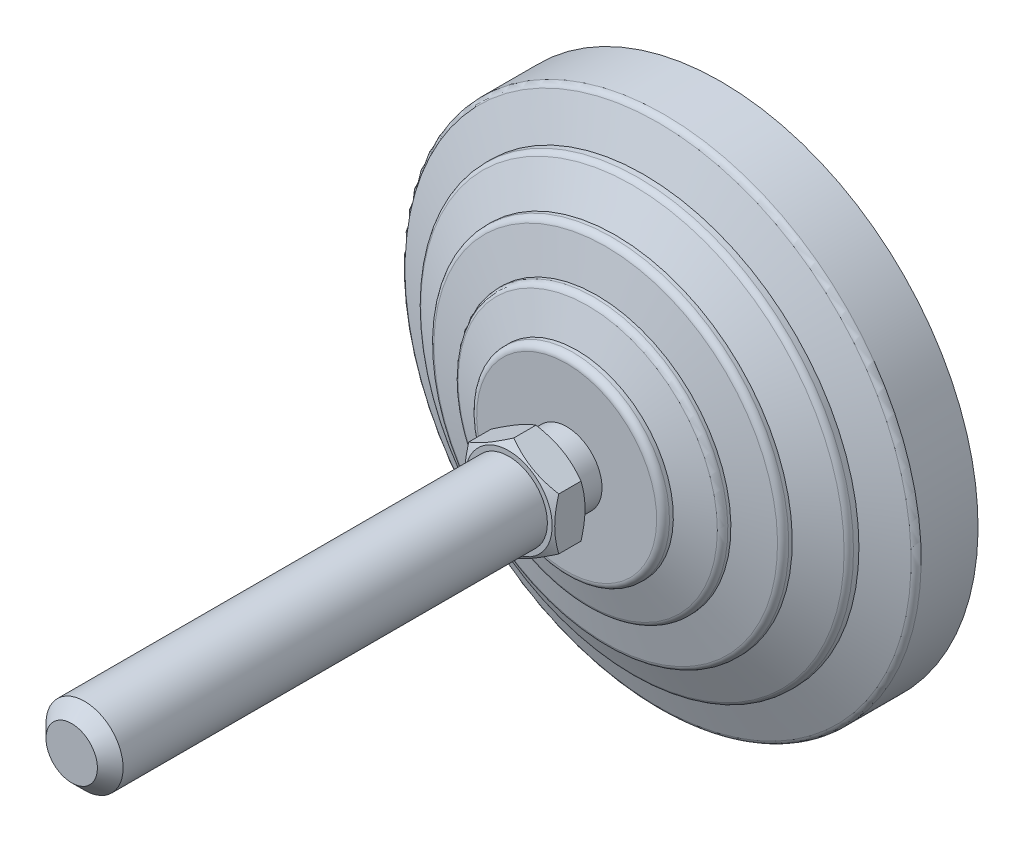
ISO-10303-21;
HEADER;
FILE_DESCRIPTION(('STEP AP214'),'2;1');
FILE_NAME('part.step','',(''),(''),'','','');
FILE_SCHEMA(('AUTOMOTIVE_DESIGN { 1 0 10303 214 1 1 1 1 }'));
ENDSEC;
DATA;
#1=APPLICATION_CONTEXT('core data for automotive mechanical design processes');
#2=APPLICATION_PROTOCOL_DEFINITION('international standard','automotive_design',2000,#1);
#3=PRODUCT_CONTEXT('',#1,'mechanical');
#4=PRODUCT('Part','Part','',(#3));
#5=PRODUCT_RELATED_PRODUCT_CATEGORY('part','',(#4));
#6=PRODUCT_DEFINITION_FORMATION('','',#4);
#7=PRODUCT_DEFINITION_CONTEXT('part definition',#1,'design');
#8=PRODUCT_DEFINITION('design','',#6,#7);
#9=PRODUCT_DEFINITION_SHAPE('','',#8);
#10=(LENGTH_UNIT() NAMED_UNIT(*) SI_UNIT(.MILLI.,.METRE.));
#11=(NAMED_UNIT(*) PLANE_ANGLE_UNIT() SI_UNIT($,.RADIAN.));
#12=(NAMED_UNIT(*) SI_UNIT($,.STERADIAN.) SOLID_ANGLE_UNIT());
#13=UNCERTAINTY_MEASURE_WITH_UNIT(LENGTH_MEASURE(1.E-05),#10,'distance_accuracy_value','');
#14=(GEOMETRIC_REPRESENTATION_CONTEXT(3) GLOBAL_UNCERTAINTY_ASSIGNED_CONTEXT((#13)) GLOBAL_UNIT_ASSIGNED_CONTEXT((#10,
#11,#12)) REPRESENTATION_CONTEXT('',''));
#15=CARTESIAN_POINT('',(0.,0.,0.));
#16=DIRECTION('',(0.,0.,1.));
#17=DIRECTION('',(1.,0.,0.));
#18=AXIS2_PLACEMENT_3D('',#15,#16,#17);
#19=CARTESIAN_POINT('',(-5.50000000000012,0.,31.));
#20=DIRECTION('',(0.,0.,1.));
#21=DIRECTION('',(0.,-1.,0.));
#22=AXIS2_PLACEMENT_3D('',#19,#20,#21);
#23=PLANE('',#22);
#24=CARTESIAN_POINT('',(0.,0.,31.));
#25=DIRECTION('',(0.,0.,-1.));
#26=DIRECTION('',(-1.,0.,0.));
#27=AXIS2_PLACEMENT_3D('',#24,#25,#26);
#28=CIRCLE('',#27,6.75);
#29=CARTESIAN_POINT('',(-6.75,0.,31.));
#30=VERTEX_POINT('',#29);
#31=EDGE_CURVE('E570',#30,#30,#28,.T.);
#32=ORIENTED_EDGE('',*,*,#31,.T.);
#33=EDGE_LOOP('',(#32));
#34=FACE_BOUND('',#33,.T.);
#35=CARTESIAN_POINT('',(0.,0.,31.));
#36=DIRECTION('',(0.,0.,-1.));
#37=DIRECTION('',(0.,1.,0.));
#38=AXIS2_PLACEMENT_3D('',#35,#36,#37);
#39=CIRCLE('',#38,5.50000000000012);
#40=CARTESIAN_POINT('',(0.,5.50000000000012,31.));
#41=VERTEX_POINT('',#40);
#42=EDGE_CURVE('E150',#41,#41,#39,.T.);
#43=ORIENTED_EDGE('',*,*,#42,.F.);
#44=EDGE_LOOP('',(#43));
#45=FACE_BOUND('',#44,.T.);
#46=ADVANCED_FACE('F14',(#34,#45),#23,.F.);
#47=CARTESIAN_POINT('',(0.,0.,0.));
#48=DIRECTION('',(0.,0.,-1.));
#49=DIRECTION('',(0.,1.,0.));
#50=AXIS2_PLACEMENT_3D('',#47,#48,#49);
#51=CYLINDRICAL_SURFACE('',#50,5.50000000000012);
#52=CARTESIAN_POINT('',(0.,0.,27.));
#53=DIRECTION('',(0.,0.,-1.));
#54=DIRECTION('',(0.,1.,0.));
#55=AXIS2_PLACEMENT_3D('',#52,#53,#54);
#56=CIRCLE('',#55,5.50000000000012);
#57=CARTESIAN_POINT('',(0.,5.50000000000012,27.));
#58=VERTEX_POINT('',#57);
#59=EDGE_CURVE('E147',#58,#58,#56,.T.);
#60=ORIENTED_EDGE('',*,*,#59,.F.);
#61=EDGE_LOOP('',(#60));
#62=FACE_BOUND('',#61,.T.);
#63=ORIENTED_EDGE('',*,*,#42,.T.);
#64=EDGE_LOOP('',(#63));
#65=FACE_BOUND('',#64,.T.);
#66=ADVANCED_FACE('F173',(#62,#65),#51,.T.);
#67=CARTESIAN_POINT('',(-5.50000000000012,0.,27.));
#68=DIRECTION('',(0.,0.,-1.));
#69=DIRECTION('',(0.,1.,0.));
#70=AXIS2_PLACEMENT_3D('',#67,#68,#69);
#71=PLANE('',#70);
#72=CARTESIAN_POINT('',(0.,0.,27.));
#73=DIRECTION('',(0.,0.,-1.));
#74=DIRECTION('',(0.,1.,0.));
#75=AXIS2_PLACEMENT_3D('',#72,#73,#74);
#76=CIRCLE('',#75,14.);
#77=CARTESIAN_POINT('',(0.,14.,27.));
#78=VERTEX_POINT('',#77);
#79=EDGE_CURVE('E144',#78,#78,#76,.T.);
#80=ORIENTED_EDGE('',*,*,#79,.F.);
#81=EDGE_LOOP('',(#80));
#82=FACE_BOUND('',#81,.T.);
#83=ORIENTED_EDGE('',*,*,#59,.T.);
#84=EDGE_LOOP('',(#83));
#85=FACE_BOUND('',#84,.T.);
#86=ADVANCED_FACE('F179',(#82,#85),#71,.F.);
#87=CARTESIAN_POINT('',(0.,0.,26.));
#88=DIRECTION('',(0.,0.,-1.));
#89=DIRECTION('',(0.,1.,0.));
#90=AXIS2_PLACEMENT_3D('',#87,#88,#89);
#91=TOROIDAL_SURFACE('',#90,14.,1.);
#92=CARTESIAN_POINT('',(0.,0.,26.));
#93=DIRECTION('',(0.,0.,-1.));
#94=DIRECTION('',(0.,1.,0.));
#95=AXIS2_PLACEMENT_3D('',#92,#93,#94);
#96=CIRCLE('',#95,15.);
#97=CARTESIAN_POINT('',(0.,15.,26.));
#98=VERTEX_POINT('',#97);
#99=EDGE_CURVE('E141',#98,#98,#96,.T.);
#100=ORIENTED_EDGE('',*,*,#99,.F.);
#101=EDGE_LOOP('',(#100));
#102=FACE_BOUND('',#101,.T.);
#103=ORIENTED_EDGE('',*,*,#79,.T.);
#104=EDGE_LOOP('',(#103));
#105=FACE_BOUND('',#104,.T.);
#106=ADVANCED_FACE('F416',(#102,#105),#91,.T.);
#107=CARTESIAN_POINT('',(0.,0.,0.));
#108=DIRECTION('',(0.,0.,-1.));
#109=DIRECTION('',(0.,1.,0.));
#110=AXIS2_PLACEMENT_3D('',#107,#108,#109);
#111=CYLINDRICAL_SURFACE('',#110,15.);
#112=CARTESIAN_POINT('',(0.,0.,25.4025287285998));
#113=DIRECTION('',(0.,0.,-1.));
#114=DIRECTION('',(0.,1.,0.));
#115=AXIS2_PLACEMENT_3D('',#112,#113,#114);
#116=CIRCLE('',#115,15.);
#117=CARTESIAN_POINT('',(0.,15.,25.4025287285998));
#118=VERTEX_POINT('',#117);
#119=EDGE_CURVE('E138',#118,#118,#116,.T.);
#120=ORIENTED_EDGE('',*,*,#119,.F.);
#121=EDGE_LOOP('',(#120));
#122=FACE_BOUND('',#121,.T.);
#123=ORIENTED_EDGE('',*,*,#99,.T.);
#124=EDGE_LOOP('',(#123));
#125=FACE_BOUND('',#124,.T.);
#126=ADVANCED_FACE('F407',(#122,#125),#111,.T.);
#127=CARTESIAN_POINT('',(0.,0.,25.4025287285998));
#128=DIRECTION('',(0.,0.,-1.));
#129=DIRECTION('',(0.,1.,0.));
#130=AXIS2_PLACEMENT_3D('',#127,#128,#129);
#131=CONICAL_SURFACE('',#130,15.,1.25589726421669);
#132=CARTESIAN_POINT('',(0.,0.,23.7216684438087));
#133=DIRECTION('',(0.,0.,-1.));
#134=DIRECTION('',(0.,1.,0.));
#135=AXIS2_PLACEMENT_3D('',#132,#133,#134);
#136=CIRCLE('',#135,20.16016354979);
#137=CARTESIAN_POINT('',(0.,20.16016354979,23.7216684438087));
#138=VERTEX_POINT('',#137);
#139=EDGE_CURVE('E135',#138,#138,#136,.T.);
#140=ORIENTED_EDGE('',*,*,#139,.F.);
#141=EDGE_LOOP('',(#140));
#142=FACE_BOUND('',#141,.T.);
#143=ORIENTED_EDGE('',*,*,#119,.T.);
#144=EDGE_LOOP('',(#143));
#145=FACE_BOUND('',#144,.T.);
#146=ADVANCED_FACE('F398',(#142,#145),#131,.T.);
#147=CARTESIAN_POINT('',(0.,0.,22.7708407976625));
#148=DIRECTION('',(0.,0.,-1.));
#149=DIRECTION('',(0.,1.,0.));
#150=AXIS2_PLACEMENT_3D('',#147,#148,#149);
#151=TOROIDAL_SURFACE('',#150,19.8504430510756,1.);
#152=CARTESIAN_POINT('',(0.,0.,22.7708407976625));
#153=DIRECTION('',(0.,0.,-1.));
#154=DIRECTION('',(0.,1.,0.));
#155=AXIS2_PLACEMENT_3D('',#152,#153,#154);
#156=CIRCLE('',#155,20.8504430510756);
#157=CARTESIAN_POINT('',(0.,20.8504430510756,22.7708407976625));
#158=VERTEX_POINT('',#157);
#159=EDGE_CURVE('E132',#158,#158,#156,.T.);
#160=ORIENTED_EDGE('',*,*,#159,.F.);
#161=EDGE_LOOP('',(#160));
#162=FACE_BOUND('',#161,.T.);
#163=ORIENTED_EDGE('',*,*,#139,.T.);
#164=EDGE_LOOP('',(#163));
#165=FACE_BOUND('',#164,.T.);
#166=ADVANCED_FACE('F389',(#162,#165),#151,.T.);
#167=CARTESIAN_POINT('',(0.,0.,0.));
#168=DIRECTION('',(0.,0.,-1.));
#169=DIRECTION('',(0.,1.,0.));
#170=AXIS2_PLACEMENT_3D('',#167,#168,#169);
#171=CYLINDRICAL_SURFACE('',#170,20.8504430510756);
#172=CARTESIAN_POINT('',(0.,0.,22.2987385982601));
#173=DIRECTION('',(0.,0.,-1.));
#174=DIRECTION('',(0.,1.,0.));
#175=AXIS2_PLACEMENT_3D('',#172,#173,#174);
#176=CIRCLE('',#175,20.8504430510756);
#177=CARTESIAN_POINT('',(0.,20.8504430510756,22.2987385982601));
#178=VERTEX_POINT('',#177);
#179=EDGE_CURVE('E129',#178,#178,#176,.T.);
#180=ORIENTED_EDGE('',*,*,#179,.F.);
#181=EDGE_LOOP('',(#180));
#182=FACE_BOUND('',#181,.T.);
#183=ORIENTED_EDGE('',*,*,#159,.T.);
#184=EDGE_LOOP('',(#183));
#185=FACE_BOUND('',#184,.T.);
#186=ADVANCED_FACE('F380',(#182,#185),#171,.T.);
#187=CARTESIAN_POINT('',(0.,0.,22.2987385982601));
#188=DIRECTION('',(0.,0.,-1.));
#189=DIRECTION('',(0.,1.,0.));
#190=AXIS2_PLACEMENT_3D('',#187,#188,#189);
#191=CONICAL_SURFACE('',#190,20.8504430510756,1.34067144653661);
#192=CARTESIAN_POINT('',(0.,0.,20.9217501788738));
#193=DIRECTION('',(0.,0.,-1.));
#194=DIRECTION('',(0.,1.,0.));
#195=AXIS2_PLACEMENT_3D('',#192,#193,#194);
#196=CIRCLE('',#195,26.728099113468);
#197=CARTESIAN_POINT('',(0.,26.728099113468,20.9217501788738));
#198=VERTEX_POINT('',#197);
#199=EDGE_CURVE('E126',#198,#198,#196,.T.);
#200=ORIENTED_EDGE('',*,*,#199,.F.);
#201=EDGE_LOOP('',(#200));
#202=FACE_BOUND('',#201,.T.);
#203=ORIENTED_EDGE('',*,*,#179,.T.);
#204=EDGE_LOOP('',(#203));
#205=FACE_BOUND('',#204,.T.);
#206=ADVANCED_FACE('F371',(#202,#205),#191,.T.);
#207=CARTESIAN_POINT('',(0.,0.,19.9481122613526));
#208=DIRECTION('',(0.,0.,-1.));
#209=DIRECTION('',(0.,1.,0.));
#210=AXIS2_PLACEMENT_3D('',#207,#208,#209);
#211=TOROIDAL_SURFACE('',#210,26.5,1.);
#212=CARTESIAN_POINT('',(0.,0.,19.9481122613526));
#213=DIRECTION('',(0.,0.,-1.));
#214=DIRECTION('',(0.,1.,0.));
#215=AXIS2_PLACEMENT_3D('',#212,#213,#214);
#216=CIRCLE('',#215,27.5);
#217=CARTESIAN_POINT('',(0.,27.5,19.9481122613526));
#218=VERTEX_POINT('',#217);
#219=EDGE_CURVE('E123',#218,#218,#216,.T.);
#220=ORIENTED_EDGE('',*,*,#219,.F.);
#221=EDGE_LOOP('',(#220));
#222=FACE_BOUND('',#221,.T.);
#223=ORIENTED_EDGE('',*,*,#199,.T.);
#224=EDGE_LOOP('',(#223));
#225=FACE_BOUND('',#224,.T.);
#226=ADVANCED_FACE('F362',(#222,#225),#211,.T.);
#227=CARTESIAN_POINT('',(0.,0.,0.));
#228=DIRECTION('',(0.,0.,-1.));
#229=DIRECTION('',(0.,1.,0.));
#230=AXIS2_PLACEMENT_3D('',#227,#228,#229);
#231=CYLINDRICAL_SURFACE('',#230,27.5);
#232=CARTESIAN_POINT('',(0.,0.,19.4025287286));
#233=DIRECTION('',(0.,0.,-1.));
#234=DIRECTION('',(0.,1.,0.));
#235=AXIS2_PLACEMENT_3D('',#232,#233,#234);
#236=CIRCLE('',#235,27.5);
#237=CARTESIAN_POINT('',(0.,27.5,19.4025287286));
#238=VERTEX_POINT('',#237);
#239=EDGE_CURVE('E120',#238,#238,#236,.T.);
#240=ORIENTED_EDGE('',*,*,#239,.F.);
#241=EDGE_LOOP('',(#240));
#242=FACE_BOUND('',#241,.T.);
#243=ORIENTED_EDGE('',*,*,#219,.T.);
#244=EDGE_LOOP('',(#243));
#245=FACE_BOUND('',#244,.T.);
#246=ADVANCED_FACE('F353',(#242,#245),#231,.T.);
#247=CARTESIAN_POINT('',(0.,0.,19.4025287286));
#248=DIRECTION('',(0.,0.,-1.));
#249=DIRECTION('',(0.,1.,0.));
#250=AXIS2_PLACEMENT_3D('',#247,#248,#249);
#251=CONICAL_SURFACE('',#250,27.5,1.12022914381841);
#252=CARTESIAN_POINT('',(0.,0.,16.7730910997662));
#253=DIRECTION('',(0.,0.,-1.));
#254=DIRECTION('',(0.,1.,0.));
#255=AXIS2_PLACEMENT_3D('',#252,#253,#254);
#256=CIRCLE('',#255,32.935476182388);
#257=CARTESIAN_POINT('',(0.,32.935476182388,16.7730910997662));
#258=VERTEX_POINT('',#257);
#259=EDGE_CURVE('E117',#258,#258,#256,.T.);
#260=ORIENTED_EDGE('',*,*,#259,.F.);
#261=EDGE_LOOP('',(#260));
#262=FACE_BOUND('',#261,.T.);
#263=ORIENTED_EDGE('',*,*,#239,.T.);
#264=EDGE_LOOP('',(#263));
#265=FACE_BOUND('',#264,.T.);
#266=ADVANCED_FACE('F344',(#262,#265),#251,.T.);
#267=CARTESIAN_POINT('',(0.,0.,15.8728908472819));
#268=DIRECTION('',(0.,0.,-1.));
#269=DIRECTION('',(0.,1.,0.));
#270=AXIS2_PLACEMENT_3D('',#267,#268,#269);
#271=TOROIDAL_SURFACE('',#270,32.5,1.);
#272=CARTESIAN_POINT('',(0.,0.,15.8728908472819));
#273=DIRECTION('',(0.,0.,-1.));
#274=DIRECTION('',(0.,1.,0.));
#275=AXIS2_PLACEMENT_3D('',#272,#273,#274);
#276=CIRCLE('',#275,33.5);
#277=CARTESIAN_POINT('',(0.,33.5,15.8728908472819));
#278=VERTEX_POINT('',#277);
#279=EDGE_CURVE('E114',#278,#278,#276,.T.);
#280=ORIENTED_EDGE('',*,*,#279,.F.);
#281=EDGE_LOOP('',(#280));
#282=FACE_BOUND('',#281,.T.);
#283=ORIENTED_EDGE('',*,*,#259,.T.);
#284=EDGE_LOOP('',(#283));
#285=FACE_BOUND('',#284,.T.);
#286=ADVANCED_FACE('F335',(#282,#285),#271,.T.);
#287=CARTESIAN_POINT('',(0.,0.,0.));
#288=DIRECTION('',(0.,0.,-1.));
#289=DIRECTION('',(0.,1.,0.));
#290=AXIS2_PLACEMENT_3D('',#287,#288,#289);
#291=CYLINDRICAL_SURFACE('',#290,33.5);
#292=CARTESIAN_POINT('',(0.,0.,15.0315037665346));
#293=DIRECTION('',(0.,0.,-1.));
#294=DIRECTION('',(0.,1.,0.));
#295=AXIS2_PLACEMENT_3D('',#292,#293,#294);
#296=CIRCLE('',#295,33.5);
#297=CARTESIAN_POINT('',(0.,33.5,15.0315037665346));
#298=VERTEX_POINT('',#297);
#299=EDGE_CURVE('E111',#298,#298,#296,.T.);
#300=ORIENTED_EDGE('',*,*,#299,.F.);
#301=EDGE_LOOP('',(#300));
#302=FACE_BOUND('',#301,.T.);
#303=ORIENTED_EDGE('',*,*,#279,.T.);
#304=EDGE_LOOP('',(#303));
#305=FACE_BOUND('',#304,.T.);
#306=ADVANCED_FACE('F326',(#302,#305),#291,.T.);
#307=CARTESIAN_POINT('',(0.,0.,15.0315037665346));
#308=DIRECTION('',(0.,0.,-1.));
#309=DIRECTION('',(0.,1.,0.));
#310=AXIS2_PLACEMENT_3D('',#307,#308,#309);
#311=CONICAL_SURFACE('',#310,33.5,1.20362249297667);
#312=CARTESIAN_POINT('',(0.,0.,12.7780502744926));
#313=DIRECTION('',(0.,0.,-1.));
#314=DIRECTION('',(0.,1.,0.));
#315=AXIS2_PLACEMENT_3D('',#312,#313,#314);
#316=CIRCLE('',#315,39.358979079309);
#317=CARTESIAN_POINT('',(0.,39.358979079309,12.7780502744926));
#318=VERTEX_POINT('',#317);
#319=EDGE_CURVE('E108',#318,#318,#316,.T.);
#320=ORIENTED_EDGE('',*,*,#319,.F.);
#321=EDGE_LOOP('',(#320));
#322=FACE_BOUND('',#321,.T.);
#323=ORIENTED_EDGE('',*,*,#299,.T.);
#324=EDGE_LOOP('',(#323));
#325=FACE_BOUND('',#324,.T.);
#326=ADVANCED_FACE('F317',(#322,#325),#311,.T.);
#327=CARTESIAN_POINT('',(0.,0.,11.8447046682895));
#328=DIRECTION('',(0.,0.,-1.));
#329=DIRECTION('',(0.,1.,0.));
#330=AXIS2_PLACEMENT_3D('',#327,#328,#329);
#331=TOROIDAL_SURFACE('',#330,39.,1.);
#332=CARTESIAN_POINT('',(0.,0.,11.8447046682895));
#333=DIRECTION('',(0.,0.,-1.));
#334=DIRECTION('',(0.,1.,0.));
#335=AXIS2_PLACEMENT_3D('',#332,#333,#334);
#336=CIRCLE('',#335,40.);
#337=CARTESIAN_POINT('',(0.,40.,11.8447046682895));
#338=VERTEX_POINT('',#337);
#339=EDGE_CURVE('E105',#338,#338,#336,.T.);
#340=ORIENTED_EDGE('',*,*,#339,.F.);
#341=EDGE_LOOP('',(#340));
#342=FACE_BOUND('',#341,.T.);
#343=ORIENTED_EDGE('',*,*,#319,.T.);
#344=EDGE_LOOP('',(#343));
#345=FACE_BOUND('',#344,.T.);
#346=ADVANCED_FACE('F308',(#342,#345),#331,.T.);
#347=CARTESIAN_POINT('',(0.,0.,0.));
#348=DIRECTION('',(0.,0.,-1.));
#349=DIRECTION('',(0.,1.,0.));
#350=AXIS2_PLACEMENT_3D('',#347,#348,#349);
#351=CYLINDRICAL_SURFACE('',#350,40.);
#352=CARTESIAN_POINT('',(0.,0.,3.));
#353=DIRECTION('',(0.,0.,-1.));
#354=DIRECTION('',(0.,1.,0.));
#355=AXIS2_PLACEMENT_3D('',#352,#353,#354);
#356=CIRCLE('',#355,40.);
#357=CARTESIAN_POINT('',(0.,40.,3.));
#358=VERTEX_POINT('',#357);
#359=EDGE_CURVE('E102',#358,#358,#356,.T.);
#360=ORIENTED_EDGE('',*,*,#359,.F.);
#361=EDGE_LOOP('',(#360));
#362=FACE_BOUND('',#361,.T.);
#363=ORIENTED_EDGE('',*,*,#339,.T.);
#364=EDGE_LOOP('',(#363));
#365=FACE_BOUND('',#364,.T.);
#366=ADVANCED_FACE('F299',(#362,#365),#351,.T.);
#367=CARTESIAN_POINT('',(-33.5,0.,3.));
#368=DIRECTION('',(0.,0.,1.));
#369=DIRECTION('',(0.,-1.,0.));
#370=AXIS2_PLACEMENT_3D('',#367,#368,#369);
#371=PLANE('',#370);
#372=CARTESIAN_POINT('',(0.,0.,3.));
#373=DIRECTION('',(0.,0.,-1.));
#374=DIRECTION('',(0.,1.,0.));
#375=AXIS2_PLACEMENT_3D('',#372,#373,#374);
#376=CIRCLE('',#375,33.5);
#377=CARTESIAN_POINT('',(0.,33.5,3.));
#378=VERTEX_POINT('',#377);
#379=EDGE_CURVE('E99',#378,#378,#376,.T.);
#380=ORIENTED_EDGE('',*,*,#379,.F.);
#381=EDGE_LOOP('',(#380));
#382=FACE_BOUND('',#381,.T.);
#383=ORIENTED_EDGE('',*,*,#359,.T.);
#384=EDGE_LOOP('',(#383));
#385=FACE_BOUND('',#384,.T.);
#386=ADVANCED_FACE('F290',(#382,#385),#371,.F.);
#387=CARTESIAN_POINT('',(0.,0.,0.));
#388=DIRECTION('',(0.,0.,-1.));
#389=DIRECTION('',(0.,1.,0.));
#390=AXIS2_PLACEMENT_3D('',#387,#388,#389);
#391=CYLINDRICAL_SURFACE('',#390,33.5);
#392=CARTESIAN_POINT('',(0.,0.,0.));
#393=DIRECTION('',(0.,0.,-1.));
#394=DIRECTION('',(0.,1.,0.));
#395=AXIS2_PLACEMENT_3D('',#392,#393,#394);
#396=CIRCLE('',#395,33.5);
#397=CARTESIAN_POINT('',(0.,33.5,0.));
#398=VERTEX_POINT('',#397);
#399=EDGE_CURVE('E96',#398,#398,#396,.T.);
#400=ORIENTED_EDGE('',*,*,#399,.F.);
#401=EDGE_LOOP('',(#400));
#402=FACE_BOUND('',#401,.T.);
#403=ORIENTED_EDGE('',*,*,#379,.T.);
#404=EDGE_LOOP('',(#403));
#405=FACE_BOUND('',#404,.T.);
#406=ADVANCED_FACE('F280',(#402,#405),#391,.T.);
#407=CARTESIAN_POINT('',(0.,0.,0.));
#408=DIRECTION('',(0.,0.,1.));
#409=DIRECTION('',(0.,-1.,0.));
#410=AXIS2_PLACEMENT_3D('',#407,#408,#409);
#411=PLANE('',#410);
#412=ORIENTED_EDGE('',*,*,#399,.T.);
#413=EDGE_LOOP('',(#412));
#414=FACE_BOUND('',#413,.T.);
#415=ADVANCED_FACE('F171',(#414),#411,.F.);
#416=CARTESIAN_POINT('',(0.,0.,32.471502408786));
#417=DIRECTION('',(0.,0.,1.));
#418=DIRECTION('',(1.,0.,0.));
#419=AXIS2_PLACEMENT_3D('',#416,#417,#418);
#420=CONICAL_SURFACE('',#419,9.29871693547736,1.0471975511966);
#421=CARTESIAN_POINT('',(0.256920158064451,-8.23123669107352,31.857506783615));
#422=CARTESIAN_POINT('',(-0.0697181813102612,-8.04265195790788,31.7427838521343));
#423=CARTESIAN_POINT('',(-0.399411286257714,-7.8523035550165,31.6377851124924));
#424=CARTESIAN_POINT('',(-1.06517639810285,-7.46792388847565,31.4534497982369));
#425=CARTESIAN_POINT('',(-1.40126526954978,-7.27388288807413,31.3741953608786));
#426=CARTESIAN_POINT('',(-1.90397982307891,-6.98364050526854,31.2807280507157));
#427=CARTESIAN_POINT('',(-2.06885788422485,-6.88844811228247,31.254027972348));
#428=CARTESIAN_POINT('',(-2.39947702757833,-6.69756506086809,31.2089780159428));
#429=CARTESIAN_POINT('',(-2.56521811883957,-6.60187439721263,31.1906282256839));
#430=CARTESIAN_POINT('',(-2.89699352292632,-6.41032377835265,31.1628024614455));
#431=CARTESIAN_POINT('',(-3.06302692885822,-6.3144643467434,31.1533121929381));
#432=CARTESIAN_POINT('',(-3.39529776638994,-6.1226276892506,31.1434256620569));
#433=CARTESIAN_POINT('',(-3.56153519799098,-6.02665046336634,31.143029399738));
#434=CARTESIAN_POINT('',(-3.90422131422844,-5.8288005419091,31.1516046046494));
#435=CARTESIAN_POINT('',(-4.08065908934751,-5.72693414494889,31.1611628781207));
#436=CARTESIAN_POINT('',(-4.43291547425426,-5.52355882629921,31.1902523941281));
#437=CARTESIAN_POINT('',(-4.6087340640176,-5.42204991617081,31.2097839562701));
#438=CARTESIAN_POINT('',(-4.9597207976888,-5.21940763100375,31.2582701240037));
#439=CARTESIAN_POINT('',(-5.13488709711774,-5.1182753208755,31.2872423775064));
#440=CARTESIAN_POINT('',(-5.48398989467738,-4.91672072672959,31.3538059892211));
#441=CARTESIAN_POINT('',(-5.65792630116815,-4.81629849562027,31.3913979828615));
#442=CARTESIAN_POINT('',(-6.00993630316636,-4.61306542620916,31.4756258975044));
#443=CARTESIAN_POINT('',(-6.18796465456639,-4.51028070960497,31.5225122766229));
#444=CARTESIAN_POINT('',(-6.54248841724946,-4.30559631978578,31.6235074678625));
#445=CARTESIAN_POINT('',(-6.71898366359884,-4.20369674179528,31.6776170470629));
#446=CARTESIAN_POINT('',(-7.06970780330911,-4.00120606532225,31.7918548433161));
#447=CARTESIAN_POINT('',(-7.24394305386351,-3.90061129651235,31.8519572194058));
#448=CARTESIAN_POINT('',(-7.59089511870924,-3.70029842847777,31.9775045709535));
#449=CARTESIAN_POINT('',(-7.76361248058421,-3.60058001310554,32.0429475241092));
#450=CARTESIAN_POINT('',(-7.93564042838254,-3.50125963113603,32.1106532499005));
#451=B_SPLINE_CURVE_WITH_KNOTS('',3,(#421,#422,#423,#424,#425,#426,#427,#428,#429,#430,#431,
#432,#433,#434,#435,#436,#437,#438,#439,#440,#441,#442,#443,#444,#445,#446,#447,#448,#449,#450),
.UNSPECIFIED.,.F.,.F.,(4,2,2,2,2,2,2,2,2,2,2,2,2,2,4),(0.,1.18343790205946,2.37061530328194,
2.94719016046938,3.52377107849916,4.09942008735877,4.67506909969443,5.28668243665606,
5.89831537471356,6.5110982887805,7.12392639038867,7.75632315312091,8.38878712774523,
9.01863305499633,9.64824157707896),.UNSPECIFIED.);
#452=CARTESIAN_POINT('',(0.,-8.08290376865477,31.7695523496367));
#453=VERTEX_POINT('',#452);
#454=CARTESIAN_POINT('',(-7.,-4.04145188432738,31.7695523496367));
#455=VERTEX_POINT('',#454);
#456=EDGE_CURVE('E73',#453,#455,#451,.T.);
#457=ORIENTED_EDGE('',*,*,#456,.T.);
#458=CARTESIAN_POINT('',(-7.,-10.7960614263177,34.5315451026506));
#459=CARTESIAN_POINT('',(-7.,-10.4908199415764,34.3837169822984));
#460=CARTESIAN_POINT('',(-7.,-10.1848712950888,34.2373237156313));
#461=CARTESIAN_POINT('',(-7.,-9.57118336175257,33.9482151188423));
#462=CARTESIAN_POINT('',(-7.,-9.2634437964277,33.8055003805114));
#463=CARTESIAN_POINT('',(-7.,-8.64418327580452,33.5238262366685));
#464=CARTESIAN_POINT('',(-7.,-8.33265081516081,33.3848920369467));
#465=CARTESIAN_POINT('',(-7.,-7.70708707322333,33.1127898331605));
#466=CARTESIAN_POINT('',(-7.,-7.39305591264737,32.9796215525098));
#467=CARTESIAN_POINT('',(-7.,-6.75209548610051,32.7165118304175));
#468=CARTESIAN_POINT('',(-7.,-6.42507046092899,32.5868023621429));
#469=CARTESIAN_POINT('',(-7.,-5.76717322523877,32.3373458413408));
#470=CARTESIAN_POINT('',(-7.,-5.43630058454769,32.2175999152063));
#471=CARTESIAN_POINT('',(-7.,-4.77081657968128,31.9912583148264));
#472=CARTESIAN_POINT('',(-7.,-4.4362145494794,31.8846354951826));
#473=CARTESIAN_POINT('',(-7.,-3.76222367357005,31.6879992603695));
#474=CARTESIAN_POINT('',(-7.,-3.42283639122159,31.5979805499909));
#475=CARTESIAN_POINT('',(-7.,-2.74089575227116,31.439392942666));
#476=CARTESIAN_POINT('',(-7.,-2.39836963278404,31.3707101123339));
#477=CARTESIAN_POINT('',(-7.,-1.88150971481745,31.2866913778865));
#478=CARTESIAN_POINT('',(-7.,-1.70869813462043,31.2618515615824));
#479=CARTESIAN_POINT('',(-7.,-1.36223650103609,31.2189956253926));
#480=CARTESIAN_POINT('',(-7.,-1.18858653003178,31.2009788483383));
#481=CARTESIAN_POINT('',(-7.,-0.842922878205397,31.1723508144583));
#482=CARTESIAN_POINT('',(-7.,-0.670916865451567,31.1616473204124));
#483=CARTESIAN_POINT('',(-7.,-0.326606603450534,31.1475194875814));
#484=CARTESIAN_POINT('',(-7.,-0.154302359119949,31.1440950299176));
#485=CARTESIAN_POINT('',(-7.,0.190297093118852,31.144606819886));
#486=CARTESIAN_POINT('',(-7.,0.362592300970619,31.148543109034));
#487=CARTESIAN_POINT('',(-7.,0.706865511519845,31.1636812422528));
#488=CARTESIAN_POINT('',(-7.,0.878843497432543,31.1748834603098));
#489=CARTESIAN_POINT('',(-7.,1.29398831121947,31.2104599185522));
#490=CARTESIAN_POINT('',(-7.,1.53685723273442,31.2383830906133));
#491=CARTESIAN_POINT('',(-7.,2.02074155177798,31.3071826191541));
#492=CARTESIAN_POINT('',(-7.,2.26175668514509,31.3480607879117));
#493=CARTESIAN_POINT('',(-7.,2.98177447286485,31.487955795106));
#494=CARTESIAN_POINT('',(-7.,3.45747022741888,31.6042060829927));
#495=CARTESIAN_POINT('',(-7.,4.16868542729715,31.8051516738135));
#496=CARTESIAN_POINT('',(-7.,4.40790991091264,31.8774822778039));
#497=CARTESIAN_POINT('',(-7.,4.88403430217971,32.0294956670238));
#498=CARTESIAN_POINT('',(-7.,5.12093419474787,32.1091784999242));
#499=CARTESIAN_POINT('',(-7.,5.59248705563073,32.2746312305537));
#500=CARTESIAN_POINT('',(-7.,5.82714077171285,32.3603990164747));
#501=CARTESIAN_POINT('',(-7.,6.29451487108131,32.5370285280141));
#502=CARTESIAN_POINT('',(-7.,6.52723527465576,32.6278902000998));
#503=CARTESIAN_POINT('',(-7.,7.06662899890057,32.8442049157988));
#504=CARTESIAN_POINT('',(-7.,7.37265427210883,32.9712706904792));
#505=CARTESIAN_POINT('',(-7.,7.98218662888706,33.2313216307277));
#506=CARTESIAN_POINT('',(-7.,8.2856935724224,33.3643071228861));
#507=CARTESIAN_POINT('',(-7.,8.89063978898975,33.6350359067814));
#508=CARTESIAN_POINT('',(-7.,9.19207866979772,33.7727800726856));
#509=CARTESIAN_POINT('',(-7.,9.79318076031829,34.0520964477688));
#510=CARTESIAN_POINT('',(-7.,10.0928439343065,34.1936687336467));
#511=CARTESIAN_POINT('',(-7.,10.6909722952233,34.4800789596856));
#512=CARTESIAN_POINT('',(-7.,10.9894359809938,34.624920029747));
#513=CARTESIAN_POINT('',(-7.,11.5850965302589,34.9171863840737));
#514=CARTESIAN_POINT('',(-7.,11.8822933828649,35.0646116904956));
#515=CARTESIAN_POINT('',(-7.,12.772207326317,35.5100544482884));
#516=CARTESIAN_POINT('',(-7.,13.3633213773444,35.8112742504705));
#517=CARTESIAN_POINT('',(-7.,14.4946179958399,36.3950921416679));
#518=CARTESIAN_POINT('',(-7.,15.0350443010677,36.6772199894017));
#519=CARTESIAN_POINT('',(-7.,16.1138813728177,37.2453426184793));
#520=CARTESIAN_POINT('',(-7.,16.6522920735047,37.5313375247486));
#521=CARTESIAN_POINT('',(-7.,17.7262694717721,38.1056065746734));
#522=CARTESIAN_POINT('',(-7.,18.2618398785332,38.3938737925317));
#523=CARTESIAN_POINT('',(-7.,19.3316861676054,38.9727352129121));
#524=CARTESIAN_POINT('',(-7.,19.8659621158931,39.263329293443));
#525=CARTESIAN_POINT('',(-7.,20.3997587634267,39.5547952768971));
#526=B_SPLINE_CURVE_WITH_KNOTS('',3,(#458,#459,#460,#461,#462,#463,#464,#465,#466,#467,#468,
#469,#470,#471,#472,#473,#474,#475,#476,#477,#478,#479,#480,#481,#482,#483,#484,#485,#486,#487,
#488,#489,#490,#491,#492,#493,#494,#495,#496,#497,#498,#499,#500,#501,#502,#503,#504,#505,#506,
#507,#508,#509,#510,#511,#512,#513,#514,#515,#516,#517,#518,#519,#520,#521,#522,#523,#524,#525),
.UNSPECIFIED.,.F.,.F.,(4,2,2,2,2,2,2,2,2,2,2,2,2,2,2,2,2,2,2,2,2,2,2,2,2,2,2,2,2,2,2,2,2,4),(0.,
1.01747507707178,2.03511283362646,3.05839232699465,4.08162268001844,5.13692520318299,
6.19234686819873,7.24554731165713,8.29841129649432,9.34555231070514,9.8692018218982,
10.3928008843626,10.9096678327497,11.4265263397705,11.9433877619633,12.4602757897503,
13.1932668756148,13.9263605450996,15.3933859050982,16.1430858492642,16.892790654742,
17.6422365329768,18.3916745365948,19.3856613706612,20.3797031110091,21.3739284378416,
22.3681736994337,23.3634151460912,24.3586651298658,26.3489200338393,28.1778129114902,
30.0067650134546,31.8314240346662,33.6559880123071),.UNSPECIFIED.);
#527=CARTESIAN_POINT('',(-7.,4.04145188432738,31.7695523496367));
#528=VERTEX_POINT('',#527);
#529=EDGE_CURVE('E81',#455,#528,#526,.T.);
#530=ORIENTED_EDGE('',*,*,#529,.T.);
#531=CARTESIAN_POINT('',(-12.6769794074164,0.763846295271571,34.435217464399));
#532=CARTESIAN_POINT('',(-12.4085217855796,0.918840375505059,34.2859323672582));
#533=CARTESIAN_POINT('',(-12.13941016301,1.07421204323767,34.1381853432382));
#534=CARTESIAN_POINT('',(-11.5995180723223,1.38591888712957,33.8466638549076));
#535=CARTESIAN_POINT('',(-11.3287372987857,1.54225423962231,33.7028901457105));
#536=CARTESIAN_POINT('',(-10.7835304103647,1.85702958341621,33.4193760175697));
#537=CARTESIAN_POINT('',(-10.509092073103,2.01547663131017,33.279666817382));
#538=CARTESIAN_POINT('',(-9.95787840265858,2.33371999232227,33.0065624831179));
#539=CARTESIAN_POINT('',(-9.68110320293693,2.49351622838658,32.8731669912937));
#540=CARTESIAN_POINT('',(-9.12221502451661,2.81619046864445,32.6132331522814));
#541=CARTESIAN_POINT('',(-8.84007640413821,2.9790832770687,32.4867678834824));
#542=CARTESIAN_POINT('',(-8.27236782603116,3.30684997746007,32.2443491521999));
#543=CARTESIAN_POINT('',(-7.98679746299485,3.47172410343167,32.128396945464));
#544=CARTESIAN_POINT('',(-7.41243263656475,3.80333379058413,31.9103589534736));
#545=CARTESIAN_POINT('',(-7.12364761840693,3.97006389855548,31.8082403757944));
#546=CARTESIAN_POINT('',(-6.54193774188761,4.30591425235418,31.6214137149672));
#547=CARTESIAN_POINT('',(-6.24901435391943,4.47503364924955,31.5366996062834));
#548=CARTESIAN_POINT('',(-5.66318842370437,4.81326040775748,31.3901755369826));
#549=CARTESIAN_POINT('',(-5.37034597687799,4.98233307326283,31.3280541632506));
#550=CARTESIAN_POINT('',(-4.92868485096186,5.2373262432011,31.2539646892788));
#551=CARTESIAN_POINT('',(-4.78104536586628,5.32256593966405,31.2324487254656));
#552=CARTESIAN_POINT('',(-4.48514720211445,5.49340282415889,31.1962074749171));
#553=CARTESIAN_POINT('',(-4.3368885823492,5.57899997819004,31.1814815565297));
#554=CARTESIAN_POINT('',(-4.04079157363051,5.74995166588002,31.1592077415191));
#555=CARTESIAN_POINT('',(-3.89295541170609,5.83530491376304,31.1516205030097));
#556=CARTESIAN_POINT('',(-3.59713839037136,6.00609495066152,31.1436555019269));
#557=CARTESIAN_POINT('',(-3.44915753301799,6.0915317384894,31.1432776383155));
#558=CARTESIAN_POINT('',(-3.15335114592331,6.26231563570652,31.1497401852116));
#559=CARTESIAN_POINT('',(-3.00552558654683,6.34766276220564,31.1565787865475));
#560=CARTESIAN_POINT('',(-2.71024376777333,6.51814379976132,31.177312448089));
#561=CARTESIAN_POINT('',(-2.56278753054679,6.60327769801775,31.1912079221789));
#562=CARTESIAN_POINT('',(-2.19872239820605,6.81347080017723,31.2339484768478));
#563=CARTESIAN_POINT('',(-1.9824563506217,6.93833206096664,31.2667574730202));
#564=CARTESIAN_POINT('',(-1.55175901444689,7.18699528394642,31.345669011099));
#565=CARTESIAN_POINT('',(-1.33732803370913,7.31079706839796,31.3917737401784));
#566=CARTESIAN_POINT('',(-0.69634274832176,7.68087009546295,31.5476994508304));
#567=CARTESIAN_POINT('',(-0.272951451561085,7.92531517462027,31.6750192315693));
#568=CARTESIAN_POINT('',(0.360001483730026,8.29075072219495,31.8925040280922));
#569=CARTESIAN_POINT('',(0.572909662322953,8.41367331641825,31.9704040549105));
#570=CARTESIAN_POINT('',(0.996670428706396,8.65833170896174,32.133463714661));
#571=CARTESIAN_POINT('',(1.20752283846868,8.78006740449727,32.2186239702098));
#572=CARTESIAN_POINT('',(1.62611412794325,9.02174119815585,32.3944186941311));
#573=CARTESIAN_POINT('',(1.83386395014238,9.14168561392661,32.485018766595));
#574=CARTESIAN_POINT('',(2.2476291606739,9.38057306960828,32.6711354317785));
#575=CARTESIAN_POINT('',(2.45364510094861,9.49951642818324,32.7666503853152));
#576=CARTESIAN_POINT('',(2.65893629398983,9.61804135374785,32.8641546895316));
#577=B_SPLINE_CURVE_WITH_KNOTS('',3,(#531,#532,#533,#534,#535,#536,#537,#538,#539,#540,#541,
#542,#543,#544,#545,#546,#547,#548,#549,#550,#551,#552,#553,#554,#555,#556,#557,#558,#559,#560,
#561,#562,#563,#564,#565,#566,#567,#568,#569,#570,#571,#572,#573,#574,#575,#576),.UNSPECIFIED.,
.F.,.F.,(4,2,2,2,2,2,2,2,2,2,2,2,2,2,2,2,2,2,2,2,2,2,4),(0.,1.03220140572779,2.0645976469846,
3.10351610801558,4.14237563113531,5.19064756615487,6.23904454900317,7.28491112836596,
8.33041500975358,9.36090655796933,9.87628762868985,10.3916207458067,10.9040968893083,
11.4165658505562,11.9289063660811,12.4412769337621,13.196448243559,13.9517438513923,
15.4653042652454,16.2389270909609,17.0126163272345,17.7818444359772,18.5508176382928),.UNSPECIFIED.);
#578=CARTESIAN_POINT('',(0.,8.08290376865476,31.7695523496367));
#579=VERTEX_POINT('',#578);
#580=EDGE_CURVE('E525',#528,#579,#577,.T.);
#581=ORIENTED_EDGE('',*,*,#580,.T.);
#582=CARTESIAN_POINT('',(-0.942114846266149,8.62683402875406,32.1132032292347));
#583=CARTESIAN_POINT('',(-0.769994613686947,8.52746036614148,32.0453968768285));
#584=CARTESIAN_POINT('',(-0.597184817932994,8.42768858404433,31.9798516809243));
#585=CARTESIAN_POINT('',(-0.250047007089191,8.22726847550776,31.8540970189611));
#586=CARTESIAN_POINT('',(-0.0757184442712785,8.1266198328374,31.7938895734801));
#587=CARTESIAN_POINT('',(0.275195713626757,7.92401944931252,31.6794383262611));
#588=CARTESIAN_POINT('',(0.45178768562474,7.82206402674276,31.6252204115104));
#589=CARTESIAN_POINT('',(0.806507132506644,7.61726665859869,31.5240073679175));
#590=CARTESIAN_POINT('',(0.984634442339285,7.5144248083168,31.4770114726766));
#591=CARTESIAN_POINT('',(1.3368391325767,7.31107933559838,31.392569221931));
#592=CARTESIAN_POINT('',(1.5108711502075,7.21060190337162,31.3548722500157));
#593=CARTESIAN_POINT('',(1.86016867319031,7.00893488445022,31.2881011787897));
#594=CARTESIAN_POINT('',(2.03543408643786,6.90774535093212,31.2590264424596));
#595=CARTESIAN_POINT('',(2.38662248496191,6.70498663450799,31.2103409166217));
#596=CARTESIAN_POINT('',(2.56254361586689,6.60341852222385,31.19071244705));
#597=CARTESIAN_POINT('',(2.91500918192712,6.39992243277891,31.1614376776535));
#598=CARTESIAN_POINT('',(3.09155359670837,6.29799446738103,31.1517910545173));
#599=CARTESIAN_POINT('',(3.43426845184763,6.10012795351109,31.1430603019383));
#600=CARTESIAN_POINT('',(3.60042758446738,6.00419593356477,31.1433787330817));
#601=CARTESIAN_POINT('',(3.93254524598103,5.81244771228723,31.1531022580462));
#602=CARTESIAN_POINT('',(4.09850377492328,5.7166315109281,31.1625073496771));
#603=CARTESIAN_POINT('',(4.43013238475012,5.5251656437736,31.1901578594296));
#604=CARTESIAN_POINT('',(4.59580156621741,5.42951649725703,31.2084175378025));
#605=CARTESIAN_POINT('',(4.92628024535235,5.23871454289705,31.253284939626));
#606=CARTESIAN_POINT('',(5.09108975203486,5.14356172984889,31.2798925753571));
#607=CARTESIAN_POINT('',(5.59359134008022,4.85344230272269,31.3730758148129));
#608=CARTESIAN_POINT('',(5.92954054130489,4.65948194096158,31.4521380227));
#609=CARTESIAN_POINT('',(6.59503700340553,4.27525737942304,31.6360994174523));
#610=CARTESIAN_POINT('',(6.92460105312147,4.08498348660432,31.7409167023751));
#611=CARTESIAN_POINT('',(7.25111099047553,3.89647288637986,31.8554678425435));
#612=B_SPLINE_CURVE_WITH_KNOTS('',3,(#582,#583,#584,#585,#586,#587,#588,#589,#590,#591,#592,
#593,#594,#595,#596,#597,#598,#599,#600,#601,#602,#603,#604,#605,#606,#607,#608,#609,#610,#611),
.UNSPECIFIED.,.F.,.F.,(4,2,2,2,2,2,2,2,2,2,2,2,2,2,4),(0.,0.630008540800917,1.26025455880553,
1.89312593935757,2.52593011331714,3.1391417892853,3.75230814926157,4.36432237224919,
4.97631677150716,5.55169445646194,6.12707200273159,6.7033792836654,7.27968050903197,
8.46626771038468,9.64912928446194),.UNSPECIFIED.);
#613=CARTESIAN_POINT('',(7.,4.04145188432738,31.7695523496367));
#614=VERTEX_POINT('',#613);
#615=EDGE_CURVE('E520',#579,#614,#612,.T.);
#616=ORIENTED_EDGE('',*,*,#615,.T.);
#617=CARTESIAN_POINT('',(7.,-10.7960614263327,34.5315451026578));
#618=CARTESIAN_POINT('',(7.,-10.4908199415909,34.3837169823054));
#619=CARTESIAN_POINT('',(7.,-10.1848712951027,34.2373237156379));
#620=CARTESIAN_POINT('',(7.,-9.57118336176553,33.9482151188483));
#621=CARTESIAN_POINT('',(7.,-9.26344379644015,33.8055003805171));
#622=CARTESIAN_POINT('',(7.,-8.64418327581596,33.5238262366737));
#623=CARTESIAN_POINT('',(7.,-8.33265081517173,33.3848920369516));
#624=CARTESIAN_POINT('',(7.,-7.70708707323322,33.1127898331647));
#625=CARTESIAN_POINT('',(7.,-7.39305591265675,32.9796215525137));
#626=CARTESIAN_POINT('',(7.,-6.75209548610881,32.7165118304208));
#627=CARTESIAN_POINT('',(7.,-6.42507046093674,32.5868023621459));
#628=CARTESIAN_POINT('',(7.,-5.76717322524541,32.3373458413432));
#629=CARTESIAN_POINT('',(7.,-5.43630058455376,32.2175999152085));
#630=CARTESIAN_POINT('',(7.,-4.77081657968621,31.991258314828));
#631=CARTESIAN_POINT('',(7.,-4.43621454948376,31.8846354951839));
#632=CARTESIAN_POINT('',(7.,-3.76222367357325,31.6879992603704));
#633=CARTESIAN_POINT('',(7.,-3.4228363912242,31.5979805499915));
#634=CARTESIAN_POINT('',(7.,-2.74089575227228,31.4393929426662));
#635=CARTESIAN_POINT('',(7.,-2.39836963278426,31.3707101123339));
#636=CARTESIAN_POINT('',(7.,-1.8815097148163,31.2866913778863));
#637=CARTESIAN_POINT('',(7.,-1.70869813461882,31.2618515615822));
#638=CARTESIAN_POINT('',(7.,-1.36223650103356,31.2189956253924));
#639=CARTESIAN_POINT('',(7.,-1.18858653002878,31.200978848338));
#640=CARTESIAN_POINT('',(7.,-0.842922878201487,31.172350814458));
#641=CARTESIAN_POINT('',(7.,-0.670916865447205,31.1616473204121));
#642=CARTESIAN_POINT('',(7.,-0.326606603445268,31.1475194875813));
#643=CARTESIAN_POINT('',(7.,-0.15430235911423,31.1440950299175));
#644=CARTESIAN_POINT('',(7.,0.190297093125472,31.1446068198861));
#645=CARTESIAN_POINT('',(7.,0.362592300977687,31.1485431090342));
#646=CARTESIAN_POINT('',(7.,0.706865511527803,31.1636812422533));
#647=CARTESIAN_POINT('',(7.,0.878843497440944,31.1748834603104));
#648=CARTESIAN_POINT('',(7.,1.29398831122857,31.2104599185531));
#649=CARTESIAN_POINT('',(7.,1.53685723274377,31.2383830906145));
#650=CARTESIAN_POINT('',(7.,2.02074155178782,31.3071826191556));
#651=CARTESIAN_POINT('',(7.,2.26175668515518,31.3480607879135));
#652=CARTESIAN_POINT('',(7.,2.98177447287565,31.4879557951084));
#653=CARTESIAN_POINT('',(7.,3.45747022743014,31.6042060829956));
#654=CARTESIAN_POINT('',(7.,4.16868542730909,31.805151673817));
#655=CARTESIAN_POINT('',(7.,4.40790991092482,31.8774822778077));
#656=CARTESIAN_POINT('',(7.,4.88403430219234,32.0294956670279));
#657=CARTESIAN_POINT('',(7.,5.12093419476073,32.1091784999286));
#658=CARTESIAN_POINT('',(7.,5.59248705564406,32.2746312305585));
#659=CARTESIAN_POINT('',(7.,5.82714077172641,32.3603990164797));
#660=CARTESIAN_POINT('',(7.,6.29451487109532,32.5370285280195));
#661=CARTESIAN_POINT('',(7.,6.52723527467,32.6278902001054));
#662=CARTESIAN_POINT('',(7.,7.06662899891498,32.8442049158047));
#663=CARTESIAN_POINT('',(7.,7.37265427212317,32.9712706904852));
#664=CARTESIAN_POINT('',(7.,7.98218662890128,33.2313216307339));
#665=CARTESIAN_POINT('',(7.,8.28569357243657,33.3643071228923));
#666=CARTESIAN_POINT('',(7.,8.89063978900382,33.6350359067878));
#667=CARTESIAN_POINT('',(7.,9.19207866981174,33.7727800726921));
#668=CARTESIAN_POINT('',(7.,9.79318076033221,34.0520964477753));
#669=CARTESIAN_POINT('',(7.,10.0928439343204,34.1936687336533));
#670=CARTESIAN_POINT('',(7.,10.690972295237,34.4800789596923));
#671=CARTESIAN_POINT('',(7.,10.9894359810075,34.6249200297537));
#672=CARTESIAN_POINT('',(7.,11.5850965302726,34.9171863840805));
#673=CARTESIAN_POINT('',(7.,11.8822933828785,35.0646116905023));
#674=CARTESIAN_POINT('',(7.,12.7722073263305,35.5100544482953));
#675=CARTESIAN_POINT('',(7.,13.3633213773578,35.8112742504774));
#676=CARTESIAN_POINT('',(7.,14.4946179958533,36.3950921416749));
#677=CARTESIAN_POINT('',(7.,15.0350443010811,36.6772199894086));
#678=CARTESIAN_POINT('',(7.,16.113881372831,37.2453426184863));
#679=CARTESIAN_POINT('',(7.,16.652292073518,37.5313375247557));
#680=CARTESIAN_POINT('',(7.,17.7262694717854,38.1056065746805));
#681=CARTESIAN_POINT('',(7.,18.2618398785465,38.3938737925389));
#682=CARTESIAN_POINT('',(7.,19.3316861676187,38.9727352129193));
#683=CARTESIAN_POINT('',(7.,19.8659621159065,39.2633292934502));
#684=CARTESIAN_POINT('',(7.,20.3997587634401,39.5547952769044));
#685=B_SPLINE_CURVE_WITH_KNOTS('',3,(#617,#618,#619,#620,#621,#622,#623,#624,#625,#626,#627,
#628,#629,#630,#631,#632,#633,#634,#635,#636,#637,#638,#639,#640,#641,#642,#643,#644,#645,#646,
#647,#648,#649,#650,#651,#652,#653,#654,#655,#656,#657,#658,#659,#660,#661,#662,#663,#664,#665,
#666,#667,#668,#669,#670,#671,#672,#673,#674,#675,#676,#677,#678,#679,#680,#681,#682,#683,#684),
.UNSPECIFIED.,.F.,.F.,(4,2,2,2,2,2,2,2,2,2,2,2,2,2,2,2,2,2,2,2,2,2,2,2,2,2,2,2,2,2,2,2,2,4),(0.,
1.01747507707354,2.03511283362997,3.05839232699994,4.08162268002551,5.13692520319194,
6.19234686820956,7.24554731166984,8.2984112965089,9.34555231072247,9.86920182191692,
10.3928008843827,10.9096678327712,11.4265263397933,11.9433877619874,12.4602757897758,
13.1932668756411,13.9263605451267,15.393385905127,16.1430858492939,16.8927906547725,
17.6422365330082,18.3916745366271,19.3856613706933,20.3797031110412,21.3739284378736,
22.3681736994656,23.3634151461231,24.3586651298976,26.348920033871,28.1778129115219,
30.0067650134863,31.831424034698,33.655988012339),.UNSPECIFIED.);
#686=CARTESIAN_POINT('',(7.,-4.04145188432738,31.7695523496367));
#687=VERTEX_POINT('',#686);
#688=EDGE_CURVE('E34',#614,#687,#685,.F.);
#689=ORIENTED_EDGE('',*,*,#688,.T.);
#690=CARTESIAN_POINT('',(-5.68153233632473,-11.3631379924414,34.4377502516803));
#691=CARTESIAN_POINT('',(-5.41310424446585,-11.2081609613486,34.2884589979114));
#692=CARTESIAN_POINT('',(-5.14402290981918,-11.0528067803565,34.1407038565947));
#693=CARTESIAN_POINT('',(-4.60419349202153,-10.7411361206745,33.8491606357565));
#694=CARTESIAN_POINT('',(-4.33344510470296,-10.5848194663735,33.7053733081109));
#695=CARTESIAN_POINT('',(-3.78831040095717,-10.2700857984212,33.4218271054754));
#696=CARTESIAN_POINT('',(-3.51391191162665,-10.1116617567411,33.282099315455));
#697=CARTESIAN_POINT('',(-2.96278090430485,-9.79346612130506,33.0089477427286));
#698=CARTESIAN_POINT('',(-2.68604851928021,-9.63369460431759,32.8755236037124));
#699=CARTESIAN_POINT('',(-2.1272187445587,-9.31105408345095,32.6155042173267));
#700=CARTESIAN_POINT('',(-1.84509542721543,-9.14817011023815,32.4889828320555));
#701=CARTESIAN_POINT('',(-1.27742062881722,-8.82042291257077,32.2464362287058));
#702=CARTESIAN_POINT('',(-0.991868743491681,-8.65555945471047,32.1304122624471));
#703=CARTESIAN_POINT('',(-0.417541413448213,-8.32397141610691,31.9122099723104));
#704=CARTESIAN_POINT('',(-0.128775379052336,-8.15725226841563,31.8099990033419));
#705=CARTESIAN_POINT('',(0.452895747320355,-7.82142428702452,31.6229633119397));
#706=CARTESIAN_POINT('',(0.745799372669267,-7.65231630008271,31.5381325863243));
#707=CARTESIAN_POINT('',(1.33167185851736,-7.31406266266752,31.3913298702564));
#708=CARTESIAN_POINT('',(1.62458176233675,-7.14495105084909,31.3290529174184));
#709=CARTESIAN_POINT('',(2.06635062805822,-6.88989567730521,31.2547252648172));
#710=CARTESIAN_POINT('',(2.21402706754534,-6.80463464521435,31.2331291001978));
#711=CARTESIAN_POINT('',(2.51000172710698,-6.63375359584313,31.1967273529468));
#712=CARTESIAN_POINT('',(2.65829988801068,-6.54813361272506,31.1819211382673));
#713=CARTESIAN_POINT('',(2.95447467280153,-6.37713702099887,31.1594890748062));
#714=CARTESIAN_POINT('',(3.10234904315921,-6.29176171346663,31.1518236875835));
#715=CARTESIAN_POINT('',(3.39824532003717,-6.12092591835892,31.1437054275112));
#716=CARTESIAN_POINT('',(3.54626722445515,-6.03546543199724,31.1432524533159));
#717=CARTESIAN_POINT('',(3.84215819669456,-5.86463269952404,31.1495695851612));
#718=CARTESIAN_POINT('',(3.99002729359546,-5.77926043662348,31.1563378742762));
#719=CARTESIAN_POINT('',(4.28539837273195,-5.6087278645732,31.1769371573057));
#720=CARTESIAN_POINT('',(4.43290033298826,-5.52356756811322,31.1907685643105));
#721=CARTESIAN_POINT('',(4.79685134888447,-5.31344035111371,31.2333328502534));
#722=CARTESIAN_POINT('',(5.01295985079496,-5.18867004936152,31.266018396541));
#723=CARTESIAN_POINT('',(5.44334794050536,-4.94018536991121,31.3446738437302));
#724=CARTESIAN_POINT('',(5.65762722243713,-4.81647116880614,31.3906459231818));
#725=CARTESIAN_POINT('',(6.29816351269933,-4.44665736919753,31.5461672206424));
#726=CARTESIAN_POINT('',(6.72126479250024,-4.20237973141,31.6732093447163));
#727=CARTESIAN_POINT('',(7.35379688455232,-3.83718715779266,31.890283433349));
#728=CARTESIAN_POINT('',(7.56657084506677,-3.7143420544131,31.9680483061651));
#729=CARTESIAN_POINT('',(7.99006435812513,-3.46983796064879,32.1308408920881));
#730=CARTESIAN_POINT('',(8.20078373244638,-3.34817907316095,32.2158692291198));
#731=CARTESIAN_POINT('',(8.6191109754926,-3.10665772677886,32.3914048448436));
#732=CARTESIAN_POINT('',(8.82672977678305,-2.98678895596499,32.4818777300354));
#733=CARTESIAN_POINT('',(9.24023290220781,-2.74805281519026,32.6677435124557));
#734=CARTESIAN_POINT('',(9.4461177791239,-2.62918512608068,32.7631347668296));
#735=CARTESIAN_POINT('',(9.65127771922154,-2.51073597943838,32.8605170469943));
#736=B_SPLINE_CURVE_WITH_KNOTS('',3,(#690,#691,#692,#693,#694,#695,#696,#697,#698,#699,#700,
#701,#702,#703,#704,#705,#706,#707,#708,#709,#710,#711,#712,#713,#714,#715,#716,#717,#718,#719,
#720,#721,#722,#723,#724,#725,#726,#727,#728,#729,#730,#731,#732,#733,#734,#735),.UNSPECIFIED.,
.F.,.F.,(4,2,2,2,2,2,2,2,2,2,2,2,2,2,2,2,2,2,2,2,2,2,4),(0.,1.0321172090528,2.06442867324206,
3.10324348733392,4.14199951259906,5.19028335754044,6.23869204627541,7.28457793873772,
8.33010196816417,9.36090865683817,9.87644694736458,10.3919372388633,10.904556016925,
11.4171675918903,11.9296502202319,12.4421628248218,13.1967453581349,13.9514516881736,
15.4638293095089,16.2368862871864,17.0100097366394,17.7786783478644,18.5470918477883),.UNSPECIFIED.);
#737=EDGE_CURVE('E9',#687,#453,#736,.F.);
#738=ORIENTED_EDGE('',*,*,#737,.T.);
#739=EDGE_LOOP('',(#457,#530,#581,#616,#689,#738));
#740=FACE_BOUND('',#739,.T.);
#741=ORIENTED_EDGE('',*,*,#31,.F.);
#742=EDGE_LOOP('',(#741));
#743=FACE_BOUND('',#742,.T.);
#744=ADVANCED_FACE('F71',(#740,#743),#420,.T.);
#745=CARTESIAN_POINT('',(-4.,0.,104.));
#746=DIRECTION('',(0.,0.,-1.));
#747=DIRECTION('',(0.,1.,0.));
#748=AXIS2_PLACEMENT_3D('',#745,#746,#747);
#749=PLANE('',#748);
#750=CARTESIAN_POINT('',(0.,0.,104.));
#751=DIRECTION('',(0.,0.,-1.));
#752=DIRECTION('',(0.,1.,0.));
#753=AXIS2_PLACEMENT_3D('',#750,#751,#752);
#754=CIRCLE('',#753,4.);
#755=CARTESIAN_POINT('',(0.,4.,104.));
#756=VERTEX_POINT('',#755);
#757=EDGE_CURVE('E28',#756,#756,#754,.T.);
#758=ORIENTED_EDGE('',*,*,#757,.F.);
#759=EDGE_LOOP('',(#758));
#760=FACE_BOUND('',#759,.T.);
#761=ADVANCED_FACE('F16',(#760),#749,.F.);
#762=CARTESIAN_POINT('',(0.,0.,104.));
#763=DIRECTION('',(0.,0.,-1.));
#764=DIRECTION('',(0.,1.,0.));
#765=AXIS2_PLACEMENT_3D('',#762,#763,#764);
#766=CONICAL_SURFACE('',#765,4.,0.785398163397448);
#767=CARTESIAN_POINT('',(0.,0.,102.));
#768=DIRECTION('',(0.,0.,-1.));
#769=DIRECTION('',(0.,1.,0.));
#770=AXIS2_PLACEMENT_3D('',#767,#768,#769);
#771=CIRCLE('',#770,6.);
#772=CARTESIAN_POINT('',(0.,6.,102.));
#773=VERTEX_POINT('',#772);
#774=EDGE_CURVE('E156',#773,#773,#771,.T.);
#775=ORIENTED_EDGE('',*,*,#774,.F.);
#776=EDGE_LOOP('',(#775));
#777=FACE_BOUND('',#776,.T.);
#778=ORIENTED_EDGE('',*,*,#757,.T.);
#779=EDGE_LOOP('',(#778));
#780=FACE_BOUND('',#779,.T.);
#781=ADVANCED_FACE('F161',(#777,#780),#766,.T.);
#782=CARTESIAN_POINT('',(0.,0.,0.));
#783=DIRECTION('',(0.,0.,-1.));
#784=DIRECTION('',(0.,1.,0.));
#785=AXIS2_PLACEMENT_3D('',#782,#783,#784);
#786=CYLINDRICAL_SURFACE('',#785,6.);
#787=CARTESIAN_POINT('',(0.,0.,36.));
#788=DIRECTION('',(0.,0.,-1.));
#789=DIRECTION('',(0.,1.,0.));
#790=AXIS2_PLACEMENT_3D('',#787,#788,#789);
#791=CIRCLE('',#790,6.);
#792=CARTESIAN_POINT('',(0.,6.,36.));
#793=VERTEX_POINT('',#792);
#794=EDGE_CURVE('E153',#793,#793,#791,.T.);
#795=ORIENTED_EDGE('',*,*,#794,.F.);
#796=EDGE_LOOP('',(#795));
#797=FACE_BOUND('',#796,.T.);
#798=ORIENTED_EDGE('',*,*,#774,.T.);
#799=EDGE_LOOP('',(#798));
#800=FACE_BOUND('',#799,.T.);
#801=ADVANCED_FACE('F169',(#797,#800),#786,.T.);
#802=CARTESIAN_POINT('',(-6.,0.,36.));
#803=DIRECTION('',(0.,0.,-1.));
#804=DIRECTION('',(0.,1.,0.));
#805=AXIS2_PLACEMENT_3D('',#802,#803,#804);
#806=PLANE('',#805);
#807=CARTESIAN_POINT('',(0.,0.,36.));
#808=DIRECTION('',(0.,0.,-1.));
#809=DIRECTION('',(-1.,0.,0.));
#810=AXIS2_PLACEMENT_3D('',#807,#808,#809);
#811=CIRCLE('',#810,6.75);
#812=CARTESIAN_POINT('',(-6.75,0.,36.));
#813=VERTEX_POINT('',#812);
#814=EDGE_CURVE('E80',#813,#813,#811,.T.);
#815=ORIENTED_EDGE('',*,*,#814,.F.);
#816=EDGE_LOOP('',(#815));
#817=FACE_BOUND('',#816,.T.);
#818=ORIENTED_EDGE('',*,*,#794,.T.);
#819=EDGE_LOOP('',(#818));
#820=FACE_BOUND('',#819,.T.);
#821=ADVANCED_FACE('F186',(#817,#820),#806,.F.);
#822=CARTESIAN_POINT('',(0.,0.,36.));
#823=DIRECTION('',(0.,0.,-1.));
#824=DIRECTION('',(-1.,0.,0.));
#825=AXIS2_PLACEMENT_3D('',#822,#823,#824);
#826=CONICAL_SURFACE('',#825,6.75,1.0471975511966);
#827=CARTESIAN_POINT('',(-7.93564042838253,-3.50125963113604,34.8893467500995));
#828=CARTESIAN_POINT('',(-7.7636124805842,-3.60058001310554,34.9570524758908));
#829=CARTESIAN_POINT('',(-7.59089511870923,-3.70029842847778,35.0224954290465));
#830=CARTESIAN_POINT('',(-7.2439430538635,-3.90061129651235,35.1480427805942));
#831=CARTESIAN_POINT('',(-7.0697078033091,-4.00120606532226,35.2081451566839));
#832=CARTESIAN_POINT('',(-6.71898366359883,-4.20369674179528,35.3223829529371));
#833=CARTESIAN_POINT('',(-6.54248841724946,-4.30559631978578,35.3764925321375));
#834=CARTESIAN_POINT('',(-6.18796465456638,-4.51028070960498,35.4774877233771));
#835=CARTESIAN_POINT('',(-6.00993630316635,-4.61306542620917,35.5243741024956));
#836=CARTESIAN_POINT('',(-5.65792630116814,-4.81629849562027,35.6086020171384));
#837=CARTESIAN_POINT('',(-5.48398989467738,-4.91672072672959,35.6461940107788));
#838=CARTESIAN_POINT('',(-5.13488709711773,-5.11827532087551,35.7127576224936));
#839=CARTESIAN_POINT('',(-4.95972079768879,-5.21940763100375,35.7417298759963));
#840=CARTESIAN_POINT('',(-4.60873406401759,-5.42204991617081,35.7902160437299));
#841=CARTESIAN_POINT('',(-4.43291547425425,-5.52355882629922,35.8097476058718));
#842=CARTESIAN_POINT('',(-4.0806590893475,-5.72693414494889,35.8388371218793));
#843=CARTESIAN_POINT('',(-3.90422131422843,-5.8288005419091,35.8483953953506));
#844=CARTESIAN_POINT('',(-3.56153519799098,-6.02665046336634,35.856970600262));
#845=CARTESIAN_POINT('',(-3.39529776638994,-6.1226276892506,35.8565743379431));
#846=CARTESIAN_POINT('',(-3.06302692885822,-6.3144643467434,35.8466878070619));
#847=CARTESIAN_POINT('',(-2.89699352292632,-6.41032377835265,35.8371975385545));
#848=CARTESIAN_POINT('',(-2.56521811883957,-6.60187439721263,35.8093717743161));
#849=CARTESIAN_POINT('',(-2.39947702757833,-6.69756506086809,35.7910219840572));
#850=CARTESIAN_POINT('',(-2.06885788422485,-6.88844811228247,35.745972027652));
#851=CARTESIAN_POINT('',(-1.90397982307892,-6.98364050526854,35.7192719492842));
#852=CARTESIAN_POINT('',(-1.40126526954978,-7.27388288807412,35.6258046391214));
#853=CARTESIAN_POINT('',(-1.06517639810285,-7.46792388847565,35.5465502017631));
#854=CARTESIAN_POINT('',(-0.399411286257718,-7.85230355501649,35.3622148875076));
#855=CARTESIAN_POINT('',(-0.0697181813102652,-8.04265195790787,35.2572161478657));
#856=CARTESIAN_POINT('',(0.256920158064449,-8.23123669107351,35.1424932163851));
#857=B_SPLINE_CURVE_WITH_KNOTS('',3,(#827,#828,#829,#830,#831,#832,#833,#834,#835,#836,#837,
#838,#839,#840,#841,#842,#843,#844,#845,#846,#847,#848,#849,#850,#851,#852,#853,#854,#855,#856),
.UNSPECIFIED.,.F.,.F.,(4,2,2,2,2,2,2,2,2,2,2,2,2,2,4),(0.,0.629608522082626,1.25945444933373,
1.89191842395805,2.52431518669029,3.13714328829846,3.7499262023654,4.3615591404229,
4.97317247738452,5.54882148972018,6.1244704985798,6.70105141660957,7.27762627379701,
8.46480367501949,9.64824157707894),.UNSPECIFIED.);
#858=CARTESIAN_POINT('',(-7.,-4.04145188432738,35.2304476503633));
#859=VERTEX_POINT('',#858);
#860=CARTESIAN_POINT('',(0.,-8.08290376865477,35.2304476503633));
#861=VERTEX_POINT('',#860);
#862=EDGE_CURVE('E88',#859,#861,#857,.T.);
#863=ORIENTED_EDGE('',*,*,#862,.T.);
#864=CARTESIAN_POINT('',(-5.68153233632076,-11.3631379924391,32.5622497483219));
#865=CARTESIAN_POINT('',(-5.41310424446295,-11.208160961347,32.7115410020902));
#866=CARTESIAN_POINT('',(-5.14402290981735,-11.0528067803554,32.8592961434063));
#867=CARTESIAN_POINT('',(-4.60419349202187,-10.7411361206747,33.1508393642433));
#868=CARTESIAN_POINT('',(-4.33344510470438,-10.5848194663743,33.2946266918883));
#869=CARTESIAN_POINT('',(-3.78831040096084,-10.2700857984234,33.5781728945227));
#870=CARTESIAN_POINT('',(-3.51391191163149,-10.1116617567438,33.7179006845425));
#871=CARTESIAN_POINT('',(-2.96278090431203,-9.7934661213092,33.9910522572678));
#872=CARTESIAN_POINT('',(-2.68604851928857,-9.63369460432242,34.1244763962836));
#873=CARTESIAN_POINT('',(-2.12721874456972,-9.31105408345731,34.3844957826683));
#874=CARTESIAN_POINT('',(-1.84509542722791,-9.14817011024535,34.511017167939));
#875=CARTESIAN_POINT('',(-1.27742062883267,-8.8204229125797,34.7535637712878));
#876=CARTESIAN_POINT('',(-0.991868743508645,-8.65555945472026,34.8695877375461));
#877=CARTESIAN_POINT('',(-0.417541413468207,-8.32397141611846,35.0877900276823));
#878=CARTESIAN_POINT('',(-0.128775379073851,-8.15725226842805,35.1900009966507));
#879=CARTESIAN_POINT('',(0.452895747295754,-7.82142428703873,35.3770366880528));
#880=CARTESIAN_POINT('',(0.745799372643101,-7.65231630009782,35.4618674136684));
#881=CARTESIAN_POINT('',(1.33167185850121,-7.31406266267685,35.6086701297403));
#882=CARTESIAN_POINT('',(1.62458176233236,-7.14495105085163,35.6709470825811));
#883=CARTESIAN_POINT('',(2.06635062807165,-6.88989567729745,35.745274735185));
#884=CARTESIAN_POINT('',(2.21402706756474,-6.80463464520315,35.766870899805));
#885=CARTESIAN_POINT('',(2.51000172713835,-6.63375359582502,35.8032726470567));
#886=CARTESIAN_POINT('',(2.65829988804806,-6.54813361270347,35.8180788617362));
#887=CARTESIAN_POINT('',(2.95447467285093,-6.37713702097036,35.8405109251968));
#888=CARTESIAN_POINT('',(3.1023490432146,-6.29176171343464,35.848176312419));
#889=CARTESIAN_POINT('',(3.39824532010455,-6.12092591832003,35.8562945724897));
#890=CARTESIAN_POINT('',(3.5462672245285,-6.03546543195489,35.8567475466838));
#891=CARTESIAN_POINT('',(3.84215819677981,-5.86463269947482,35.8504304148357));
#892=CARTESIAN_POINT('',(3.99002729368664,-5.77926043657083,35.843662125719));
#893=CARTESIAN_POINT('',(4.28539837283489,-5.60872786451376,35.8230628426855));
#894=CARTESIAN_POINT('',(4.43290033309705,-5.52356756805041,35.8092314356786));
#895=CARTESIAN_POINT('',(4.79685134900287,-5.31344035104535,35.7666671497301));
#896=CARTESIAN_POINT('',(5.01295985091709,-5.18867004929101,35.7339816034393));
#897=CARTESIAN_POINT('',(5.4433479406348,-4.94018536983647,35.6553261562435));
#898=CARTESIAN_POINT('',(5.65762722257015,-4.81647116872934,35.6093540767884));
#899=CARTESIAN_POINT('',(6.29816351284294,-4.44665736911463,35.4538327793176));
#900=CARTESIAN_POINT('',(6.72126479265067,-4.20237973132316,35.3267906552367));
#901=CARTESIAN_POINT('',(7.35379688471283,-3.83718715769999,35.1097165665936));
#902=CARTESIAN_POINT('',(7.56657084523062,-3.7143420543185,35.031951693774));
#903=CARTESIAN_POINT('',(7.99006435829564,-3.46983796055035,34.8691591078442));
#904=CARTESIAN_POINT('',(8.20078373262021,-3.34817907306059,34.7841307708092));
#905=CARTESIAN_POINT('',(8.61911097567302,-3.1066577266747,34.6085951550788));
#906=CARTESIAN_POINT('',(8.82672977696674,-2.98678895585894,34.5181222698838));
#907=CARTESIAN_POINT('',(9.24023290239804,-2.74805281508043,34.332256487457));
#908=CARTESIAN_POINT('',(9.44611777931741,-2.62918512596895,34.2368652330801));
#909=CARTESIAN_POINT('',(9.65127771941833,-2.51073597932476,34.1394829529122));
#910=B_SPLINE_CURVE_WITH_KNOTS('',3,(#864,#865,#866,#867,#868,#869,#870,#871,#872,#873,#874,
#875,#876,#877,#878,#879,#880,#881,#882,#883,#884,#885,#886,#887,#888,#889,#890,#891,#892,#893,
#894,#895,#896,#897,#898,#899,#900,#901,#902,#903,#904,#905,#906,#907,#908,#909),.UNSPECIFIED.,
.F.,.F.,(4,2,2,2,2,2,2,2,2,2,2,2,2,2,2,2,2,2,2,2,2,2,4),(0.,1.03211720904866,2.06442867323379,
3.10324348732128,4.14199951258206,5.19028335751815,6.23869204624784,7.28457793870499,
8.33010196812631,9.36090865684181,9.87644694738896,10.3919372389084,10.9045560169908,
11.4171675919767,11.9296502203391,12.4421628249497,13.1967453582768,13.9514516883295,
15.4638293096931,16.2368862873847,17.0100097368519,17.7786783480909,18.5470918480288),.UNSPECIFIED.);
#911=CARTESIAN_POINT('',(7.,-4.04145188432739,35.2304476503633));
#912=VERTEX_POINT('',#911);
#913=EDGE_CURVE('E86',#861,#912,#910,.T.);
#914=ORIENTED_EDGE('',*,*,#913,.T.);
#915=CARTESIAN_POINT('',(7.,-10.7960614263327,32.4684548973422));
#916=CARTESIAN_POINT('',(7.,-10.4908199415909,32.6162830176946));
#917=CARTESIAN_POINT('',(7.,-10.1848712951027,32.7626762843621));
#918=CARTESIAN_POINT('',(7.,-9.57118336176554,33.0517848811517));
#919=CARTESIAN_POINT('',(7.,-9.26344379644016,33.1944996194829));
#920=CARTESIAN_POINT('',(7.,-8.64418327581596,33.4761737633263));
#921=CARTESIAN_POINT('',(7.,-8.33265081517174,33.6151079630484));
#922=CARTESIAN_POINT('',(7.,-7.70708707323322,33.8872101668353));
#923=CARTESIAN_POINT('',(7.,-7.39305591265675,34.0203784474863));
#924=CARTESIAN_POINT('',(7.,-6.75209548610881,34.2834881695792));
#925=CARTESIAN_POINT('',(7.,-6.42507046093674,34.4131976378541));
#926=CARTESIAN_POINT('',(7.,-5.7671732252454,34.6626541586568));
#927=CARTESIAN_POINT('',(7.,-5.43630058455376,34.7824000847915));
#928=CARTESIAN_POINT('',(7.,-4.7708165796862,35.008741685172));
#929=CARTESIAN_POINT('',(7.,-4.43621454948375,35.1153645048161));
#930=CARTESIAN_POINT('',(7.,-3.76222367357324,35.3120007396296));
#931=CARTESIAN_POINT('',(7.,-3.4228363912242,35.4020194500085));
#932=CARTESIAN_POINT('',(7.,-2.74089575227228,35.5606070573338));
#933=CARTESIAN_POINT('',(7.,-2.39836963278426,35.6292898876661));
#934=CARTESIAN_POINT('',(7.,-1.8815097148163,35.7133086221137));
#935=CARTESIAN_POINT('',(7.,-1.70869813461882,35.7381484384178));
#936=CARTESIAN_POINT('',(7.,-1.36223650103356,35.7810043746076));
#937=CARTESIAN_POINT('',(7.,-1.18858653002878,35.799021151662));
#938=CARTESIAN_POINT('',(7.,-0.842922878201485,35.827649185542));
#939=CARTESIAN_POINT('',(7.,-0.670916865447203,35.8383526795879));
#940=CARTESIAN_POINT('',(7.,-0.326606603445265,35.8524805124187));
#941=CARTESIAN_POINT('',(7.,-0.154302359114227,35.8559049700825));
#942=CARTESIAN_POINT('',(7.,0.190297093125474,35.8553931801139));
#943=CARTESIAN_POINT('',(7.,0.362592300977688,35.8514568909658));
#944=CARTESIAN_POINT('',(7.,0.706865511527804,35.8363187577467));
#945=CARTESIAN_POINT('',(7.,0.878843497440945,35.8251165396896));
#946=CARTESIAN_POINT('',(7.,1.29398831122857,35.7895400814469));
#947=CARTESIAN_POINT('',(7.,1.53685723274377,35.7616169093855));
#948=CARTESIAN_POINT('',(7.,2.02074155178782,35.6928173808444));
#949=CARTESIAN_POINT('',(7.,2.26175668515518,35.6519392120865));
#950=CARTESIAN_POINT('',(7.,2.98177447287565,35.5120442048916));
#951=CARTESIAN_POINT('',(7.,3.45747022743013,35.3957939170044));
#952=CARTESIAN_POINT('',(7.,4.16868542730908,35.194848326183));
#953=CARTESIAN_POINT('',(7.,4.40790991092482,35.1225177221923));
#954=CARTESIAN_POINT('',(7.,4.88403430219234,34.970504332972));
#955=CARTESIAN_POINT('',(7.,5.12093419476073,34.8908215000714));
#956=CARTESIAN_POINT('',(7.,5.59248705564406,34.7253687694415));
#957=CARTESIAN_POINT('',(7.,5.8271407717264,34.6396009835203));
#958=CARTESIAN_POINT('',(7.,6.29451487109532,34.4629714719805));
#959=CARTESIAN_POINT('',(7.,6.52723527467,34.3721097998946));
#960=CARTESIAN_POINT('',(7.,7.06662899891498,34.1557950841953));
#961=CARTESIAN_POINT('',(7.,7.37265427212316,34.0287293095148));
#962=CARTESIAN_POINT('',(7.,7.98218662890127,33.7686783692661));
#963=CARTESIAN_POINT('',(7.,8.28569357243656,33.6356928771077));
#964=CARTESIAN_POINT('',(7.,8.89063978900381,33.3649640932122));
#965=CARTESIAN_POINT('',(7.,9.19207866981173,33.2272199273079));
#966=CARTESIAN_POINT('',(7.,9.7931807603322,32.9479035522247));
#967=CARTESIAN_POINT('',(7.,10.0928439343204,32.8063312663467));
#968=CARTESIAN_POINT('',(7.,10.690972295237,32.5199210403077));
#969=CARTESIAN_POINT('',(7.,10.9894359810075,32.3750799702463));
#970=CARTESIAN_POINT('',(7.,11.5850965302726,32.0828136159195));
#971=CARTESIAN_POINT('',(7.,11.8822933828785,31.9353883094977));
#972=CARTESIAN_POINT('',(7.,12.7722073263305,31.4899455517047));
#973=CARTESIAN_POINT('',(7.,13.3633213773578,31.1887257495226));
#974=CARTESIAN_POINT('',(7.,14.4946179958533,30.6049078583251));
#975=CARTESIAN_POINT('',(7.,15.0350443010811,30.3227800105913));
#976=CARTESIAN_POINT('',(7.,16.113881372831,29.7546573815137));
#977=CARTESIAN_POINT('',(7.,16.652292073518,29.4686624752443));
#978=CARTESIAN_POINT('',(7.,17.7262694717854,28.8943934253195));
#979=CARTESIAN_POINT('',(7.,18.2618398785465,28.6061262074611));
#980=CARTESIAN_POINT('',(7.,19.3316861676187,28.0272647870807));
#981=CARTESIAN_POINT('',(7.,19.8659621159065,27.7366707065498));
#982=CARTESIAN_POINT('',(7.,20.3997587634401,27.4452047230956));
#983=B_SPLINE_CURVE_WITH_KNOTS('',3,(#915,#916,#917,#918,#919,#920,#921,#922,#923,#924,#925,
#926,#927,#928,#929,#930,#931,#932,#933,#934,#935,#936,#937,#938,#939,#940,#941,#942,#943,#944,
#945,#946,#947,#948,#949,#950,#951,#952,#953,#954,#955,#956,#957,#958,#959,#960,#961,#962,#963,
#964,#965,#966,#967,#968,#969,#970,#971,#972,#973,#974,#975,#976,#977,#978,#979,#980,#981,#982),
.UNSPECIFIED.,.F.,.F.,(4,2,2,2,2,2,2,2,2,2,2,2,2,2,2,2,2,2,2,2,2,2,2,2,2,2,2,2,2,2,2,2,2,4),(0.,
1.01747507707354,2.03511283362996,3.05839232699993,4.08162268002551,5.13692520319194,
6.19234686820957,7.24554731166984,8.2984112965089,9.34555231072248,9.86920182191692,
10.3928008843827,10.9096678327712,11.4265263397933,11.9433877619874,12.4602757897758,
13.1932668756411,13.9263605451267,15.393385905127,16.1430858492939,16.8927906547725,
17.6422365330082,18.391674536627,19.3856613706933,20.3797031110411,21.3739284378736,
22.3681736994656,23.3634151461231,24.3586651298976,26.348920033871,28.1778129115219,
30.0067650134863,31.831424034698,33.655988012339),.UNSPECIFIED.);
#984=CARTESIAN_POINT('',(7.,4.04145188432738,35.2304476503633));
#985=VERTEX_POINT('',#984);
#986=EDGE_CURVE('E565',#912,#985,#983,.T.);
#987=ORIENTED_EDGE('',*,*,#986,.T.);
#988=CARTESIAN_POINT('',(7.25111099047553,3.89647288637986,35.1445321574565));
#989=CARTESIAN_POINT('',(6.92460105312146,4.08498348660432,35.2590832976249));
#990=CARTESIAN_POINT('',(6.59503700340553,4.27525737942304,35.3639005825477));
#991=CARTESIAN_POINT('',(5.92954054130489,4.65948194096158,35.5478619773));
#992=CARTESIAN_POINT('',(5.59359134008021,4.85344230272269,35.6269241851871));
#993=CARTESIAN_POINT('',(5.09108975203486,5.14356172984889,35.7201074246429));
#994=CARTESIAN_POINT('',(4.92628024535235,5.23871454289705,35.746715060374));
#995=CARTESIAN_POINT('',(4.59580156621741,5.42951649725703,35.7915824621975));
#996=CARTESIAN_POINT('',(4.43013238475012,5.5251656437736,35.8098421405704));
#997=CARTESIAN_POINT('',(4.09850377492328,5.7166315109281,35.8374926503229));
#998=CARTESIAN_POINT('',(3.93254524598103,5.81244771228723,35.8468977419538));
#999=CARTESIAN_POINT('',(3.60042758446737,6.00419593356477,35.8566212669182));
#1000=CARTESIAN_POINT('',(3.43426845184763,6.10012795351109,35.8569396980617));
#1001=CARTESIAN_POINT('',(3.09155359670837,6.29799446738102,35.8482089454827));
#1002=CARTESIAN_POINT('',(2.91500918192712,6.3999224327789,35.8385623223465));
#1003=CARTESIAN_POINT('',(2.5625436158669,6.60341852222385,35.80928755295));
#1004=CARTESIAN_POINT('',(2.38662248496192,6.70498663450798,35.7896590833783));
#1005=CARTESIAN_POINT('',(2.03543408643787,6.90774535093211,35.7409735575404));
#1006=CARTESIAN_POINT('',(1.86016867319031,7.00893488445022,35.7118988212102));
#1007=CARTESIAN_POINT('',(1.51087115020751,7.21060190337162,35.6451277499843));
#1008=CARTESIAN_POINT('',(1.3368391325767,7.31107933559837,35.607430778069));
#1009=CARTESIAN_POINT('',(0.984634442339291,7.51442480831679,35.5229885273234));
#1010=CARTESIAN_POINT('',(0.806507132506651,7.61726665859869,35.4759926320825));
#1011=CARTESIAN_POINT('',(0.451787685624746,7.82206402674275,35.3747795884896));
#1012=CARTESIAN_POINT('',(0.275195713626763,7.92401944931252,35.3205616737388));
#1013=CARTESIAN_POINT('',(-0.0757184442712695,8.1266198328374,35.2061104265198));
#1014=CARTESIAN_POINT('',(-0.250047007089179,8.22726847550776,35.1459029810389));
#1015=CARTESIAN_POINT('',(-0.597184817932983,8.42768858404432,35.0201483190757));
#1016=CARTESIAN_POINT('',(-0.769994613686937,8.52746036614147,34.9546031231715));
#1017=CARTESIAN_POINT('',(-0.942114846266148,8.62683402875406,34.8867967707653));
#1018=B_SPLINE_CURVE_WITH_KNOTS('',3,(#988,#989,#990,#991,#992,#993,#994,#995,#996,#997,#998,
#999,#1000,#1001,#1002,#1003,#1004,#1005,#1006,#1007,#1008,#1009,#1010,#1011,#1012,#1013,#1014,
#1015,#1016,#1017),.UNSPECIFIED.,.F.,.F.,(4,2,2,2,2,2,2,2,2,2,2,2,2,2,4),(0.,1.18286157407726,
2.36944877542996,2.94575000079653,3.52205728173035,4.097434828,4.67281251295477,
5.28480691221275,5.89682113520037,6.50998749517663,7.12319917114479,7.75600334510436,
8.3888747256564,9.01912074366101,9.64912928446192),.UNSPECIFIED.);
#1019=CARTESIAN_POINT('',(0.,8.08290376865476,35.2304476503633));
#1020=VERTEX_POINT('',#1019);
#1021=EDGE_CURVE('E542',#985,#1020,#1018,.T.);
#1022=ORIENTED_EDGE('',*,*,#1021,.T.);
#1023=CARTESIAN_POINT('',(-12.6769794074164,0.763846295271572,32.564782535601));
#1024=CARTESIAN_POINT('',(-12.4085217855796,0.918840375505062,32.7140676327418));
#1025=CARTESIAN_POINT('',(-12.13941016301,1.07421204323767,32.8618146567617));
#1026=CARTESIAN_POINT('',(-11.5995180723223,1.38591888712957,33.1533361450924));
#1027=CARTESIAN_POINT('',(-11.3287372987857,1.54225423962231,33.2971098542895));
#1028=CARTESIAN_POINT('',(-10.7835304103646,1.85702958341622,33.5806239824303));
#1029=CARTESIAN_POINT('',(-10.509092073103,2.01547663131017,33.720333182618));
#1030=CARTESIAN_POINT('',(-9.95787840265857,2.33371999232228,33.9934375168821));
#1031=CARTESIAN_POINT('',(-9.68110320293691,2.49351622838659,34.1268330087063));
#1032=CARTESIAN_POINT('',(-9.12221502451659,2.81619046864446,34.3867668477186));
#1033=CARTESIAN_POINT('',(-8.84007640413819,2.97908327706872,34.5132321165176));
#1034=CARTESIAN_POINT('',(-8.27236782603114,3.30684997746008,34.7556508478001));
#1035=CARTESIAN_POINT('',(-7.98679746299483,3.47172410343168,34.871603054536));
#1036=CARTESIAN_POINT('',(-7.41243263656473,3.80333379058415,35.0896410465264));
#1037=CARTESIAN_POINT('',(-7.12364761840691,3.97006389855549,35.1917596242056));
#1038=CARTESIAN_POINT('',(-6.5419377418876,4.30591425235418,35.3785862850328));
#1039=CARTESIAN_POINT('',(-6.24901435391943,4.47503364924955,35.4633003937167));
#1040=CARTESIAN_POINT('',(-5.66318842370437,4.81326040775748,35.6098244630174));
#1041=CARTESIAN_POINT('',(-5.37034597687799,4.98233307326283,35.6719458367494));
#1042=CARTESIAN_POINT('',(-4.92868485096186,5.2373262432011,35.7460353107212));
#1043=CARTESIAN_POINT('',(-4.78104536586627,5.32256593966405,35.7675512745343));
#1044=CARTESIAN_POINT('',(-4.48514720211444,5.49340282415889,35.8037925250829));
#1045=CARTESIAN_POINT('',(-4.33688858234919,5.57899997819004,35.8185184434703));
#1046=CARTESIAN_POINT('',(-4.0407915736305,5.74995166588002,35.8407922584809));
#1047=CARTESIAN_POINT('',(-3.89295541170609,5.83530491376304,35.8483794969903));
#1048=CARTESIAN_POINT('',(-3.59713839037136,6.00609495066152,35.8563444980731));
#1049=CARTESIAN_POINT('',(-3.44915753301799,6.0915317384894,35.8567223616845));
#1050=CARTESIAN_POINT('',(-3.15335114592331,6.26231563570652,35.8502598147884));
#1051=CARTESIAN_POINT('',(-3.00552558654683,6.34766276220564,35.8434212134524));
#1052=CARTESIAN_POINT('',(-2.71024376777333,6.51814379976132,35.822687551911));
#1053=CARTESIAN_POINT('',(-2.56278753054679,6.60327769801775,35.8087920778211));
#1054=CARTESIAN_POINT('',(-2.19872239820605,6.81347080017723,35.7660515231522));
#1055=CARTESIAN_POINT('',(-1.9824563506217,6.93833206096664,35.7332425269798));
#1056=CARTESIAN_POINT('',(-1.5517590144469,7.18699528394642,35.654330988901));
#1057=CARTESIAN_POINT('',(-1.33732803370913,7.31079706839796,35.6082262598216));
#1058=CARTESIAN_POINT('',(-0.696342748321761,7.68087009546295,35.4523005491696));
#1059=CARTESIAN_POINT('',(-0.272951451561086,7.92531517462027,35.3249807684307));
#1060=CARTESIAN_POINT('',(0.360001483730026,8.29075072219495,35.1074959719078));
#1061=CARTESIAN_POINT('',(0.572909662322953,8.41367331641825,35.0295959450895));
#1062=CARTESIAN_POINT('',(0.996670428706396,8.65833170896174,34.866536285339));
#1063=CARTESIAN_POINT('',(1.20752283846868,8.78006740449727,34.7813760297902));
#1064=CARTESIAN_POINT('',(1.62611412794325,9.02174119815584,34.6055813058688));
#1065=CARTESIAN_POINT('',(1.83386395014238,9.14168561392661,34.514981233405));
#1066=CARTESIAN_POINT('',(2.24762916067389,9.38057306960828,34.3288645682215));
#1067=CARTESIAN_POINT('',(2.4536451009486,9.49951642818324,34.2333496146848));
#1068=CARTESIAN_POINT('',(2.65893629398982,9.61804135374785,34.1358453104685));
#1069=B_SPLINE_CURVE_WITH_KNOTS('',3,(#1023,#1024,#1025,#1026,#1027,#1028,#1029,#1030,#1031,
#1032,#1033,#1034,#1035,#1036,#1037,#1038,#1039,#1040,#1041,#1042,#1043,#1044,#1045,#1046,#1047,
#1048,#1049,#1050,#1051,#1052,#1053,#1054,#1055,#1056,#1057,#1058,#1059,#1060,#1061,#1062,#1063,
#1064,#1065,#1066,#1067,#1068),.UNSPECIFIED.,.F.,.F.,(4,2,2,2,2,2,2,2,2,2,2,2,2,2,2,2,2,2,2,2,2,
2,4),(0.,1.03220140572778,2.0645976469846,3.10351610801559,4.14237563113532,5.19064756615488,
6.23904454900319,7.28491112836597,8.33041500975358,9.36090655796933,9.87628762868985,
10.3916207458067,10.9040968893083,11.4165658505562,11.9289063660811,12.4412769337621,
13.196448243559,13.9517438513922,15.4653042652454,16.2389270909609,17.0126163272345,
17.7818444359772,18.5508176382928),.UNSPECIFIED.);
#1070=CARTESIAN_POINT('',(-7.,4.04145188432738,35.2304476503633));
#1071=VERTEX_POINT('',#1070);
#1072=EDGE_CURVE('E535',#1020,#1071,#1069,.F.);
#1073=ORIENTED_EDGE('',*,*,#1072,.T.);
#1074=CARTESIAN_POINT('',(-7.,-10.7960614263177,32.4684548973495));
#1075=CARTESIAN_POINT('',(-7.,-10.4908199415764,32.6162830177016));
#1076=CARTESIAN_POINT('',(-7.,-10.1848712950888,32.7626762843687));
#1077=CARTESIAN_POINT('',(-7.,-9.57118336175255,33.0517848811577));
#1078=CARTESIAN_POINT('',(-7.,-9.26344379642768,33.1944996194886));
#1079=CARTESIAN_POINT('',(-7.,-8.6441832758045,33.4761737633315));
#1080=CARTESIAN_POINT('',(-7.,-8.33265081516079,33.6151079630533));
#1081=CARTESIAN_POINT('',(-7.,-7.70708707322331,33.8872101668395));
#1082=CARTESIAN_POINT('',(-7.,-7.39305591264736,34.0203784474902));
#1083=CARTESIAN_POINT('',(-7.,-6.75209548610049,34.2834881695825));
#1084=CARTESIAN_POINT('',(-7.,-6.42507046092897,34.4131976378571));
#1085=CARTESIAN_POINT('',(-7.,-5.76717322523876,34.6626541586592));
#1086=CARTESIAN_POINT('',(-7.,-5.43630058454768,34.7824000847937));
#1087=CARTESIAN_POINT('',(-7.,-4.77081657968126,35.0087416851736));
#1088=CARTESIAN_POINT('',(-7.,-4.43621454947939,35.1153645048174));
#1089=CARTESIAN_POINT('',(-7.,-3.76222367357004,35.3120007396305));
#1090=CARTESIAN_POINT('',(-7.,-3.42283639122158,35.4020194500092));
#1091=CARTESIAN_POINT('',(-7.,-2.74089575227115,35.560607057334));
#1092=CARTESIAN_POINT('',(-7.,-2.39836963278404,35.6292898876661));
#1093=CARTESIAN_POINT('',(-7.,-1.88150971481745,35.7133086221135));
#1094=CARTESIAN_POINT('',(-7.,-1.70869813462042,35.7381484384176));
#1095=CARTESIAN_POINT('',(-7.,-1.36223650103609,35.7810043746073));
#1096=CARTESIAN_POINT('',(-7.,-1.18858653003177,35.7990211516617));
#1097=CARTESIAN_POINT('',(-7.,-0.842922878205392,35.8276491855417));
#1098=CARTESIAN_POINT('',(-7.,-0.670916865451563,35.8383526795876));
#1099=CARTESIAN_POINT('',(-7.,-0.32660660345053,35.8524805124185));
#1100=CARTESIAN_POINT('',(-7.,-0.154302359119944,35.8559049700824));
#1101=CARTESIAN_POINT('',(-7.,0.190297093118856,35.855393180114));
#1102=CARTESIAN_POINT('',(-7.,0.362592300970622,35.851456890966));
#1103=CARTESIAN_POINT('',(-7.,0.706865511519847,35.8363187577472));
#1104=CARTESIAN_POINT('',(-7.,0.878843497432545,35.8251165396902));
#1105=CARTESIAN_POINT('',(-7.,1.29398831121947,35.7895400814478));
#1106=CARTESIAN_POINT('',(-7.,1.53685723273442,35.7616169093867));
#1107=CARTESIAN_POINT('',(-7.,2.02074155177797,35.6928173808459));
#1108=CARTESIAN_POINT('',(-7.,2.26175668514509,35.6519392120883));
#1109=CARTESIAN_POINT('',(-7.,2.98177447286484,35.512044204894));
#1110=CARTESIAN_POINT('',(-7.,3.45747022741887,35.3957939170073));
#1111=CARTESIAN_POINT('',(-7.,4.16868542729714,35.1948483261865));
#1112=CARTESIAN_POINT('',(-7.,4.40790991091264,35.1225177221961));
#1113=CARTESIAN_POINT('',(-7.,4.8840343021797,34.9705043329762));
#1114=CARTESIAN_POINT('',(-7.,5.12093419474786,34.8908215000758));
#1115=CARTESIAN_POINT('',(-7.,5.59248705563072,34.7253687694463));
#1116=CARTESIAN_POINT('',(-7.,5.82714077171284,34.6396009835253));
#1117=CARTESIAN_POINT('',(-7.,6.2945148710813,34.4629714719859));
#1118=CARTESIAN_POINT('',(-7.,6.52723527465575,34.3721097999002));
#1119=CARTESIAN_POINT('',(-7.,7.06662899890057,34.1557950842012));
#1120=CARTESIAN_POINT('',(-7.,7.37265427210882,34.0287293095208));
#1121=CARTESIAN_POINT('',(-7.,7.98218662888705,33.7686783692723));
#1122=CARTESIAN_POINT('',(-7.,8.28569357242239,33.6356928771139));
#1123=CARTESIAN_POINT('',(-7.,8.89063978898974,33.3649640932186));
#1124=CARTESIAN_POINT('',(-7.,9.19207866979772,33.2272199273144));
#1125=CARTESIAN_POINT('',(-7.,9.79318076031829,32.9479035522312));
#1126=CARTESIAN_POINT('',(-7.,10.0928439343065,32.8063312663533));
#1127=CARTESIAN_POINT('',(-7.,10.6909722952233,32.5199210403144));
#1128=CARTESIAN_POINT('',(-7.,10.9894359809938,32.375079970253));
#1129=CARTESIAN_POINT('',(-7.,11.5850965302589,32.0828136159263));
#1130=CARTESIAN_POINT('',(-7.,11.8822933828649,31.9353883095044));
#1131=CARTESIAN_POINT('',(-7.,12.772207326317,31.4899455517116));
#1132=CARTESIAN_POINT('',(-7.,13.3633213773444,31.1887257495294));
#1133=CARTESIAN_POINT('',(-7.,14.4946179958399,30.6049078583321));
#1134=CARTESIAN_POINT('',(-7.,15.0350443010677,30.3227800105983));
#1135=CARTESIAN_POINT('',(-7.,16.1138813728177,29.7546573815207));
#1136=CARTESIAN_POINT('',(-7.,16.6522920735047,29.4686624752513));
#1137=CARTESIAN_POINT('',(-7.,17.7262694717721,28.8943934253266));
#1138=CARTESIAN_POINT('',(-7.,18.2618398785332,28.6061262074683));
#1139=CARTESIAN_POINT('',(-7.,19.3316861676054,28.0272647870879));
#1140=CARTESIAN_POINT('',(-7.,19.8659621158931,27.736670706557));
#1141=CARTESIAN_POINT('',(-7.,20.3997587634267,27.4452047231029));
#1142=B_SPLINE_CURVE_WITH_KNOTS('',3,(#1074,#1075,#1076,#1077,#1078,#1079,#1080,#1081,#1082,
#1083,#1084,#1085,#1086,#1087,#1088,#1089,#1090,#1091,#1092,#1093,#1094,#1095,#1096,#1097,#1098,
#1099,#1100,#1101,#1102,#1103,#1104,#1105,#1106,#1107,#1108,#1109,#1110,#1111,#1112,#1113,#1114,
#1115,#1116,#1117,#1118,#1119,#1120,#1121,#1122,#1123,#1124,#1125,#1126,#1127,#1128,#1129,#1130,
#1131,#1132,#1133,#1134,#1135,#1136,#1137,#1138,#1139,#1140,#1141),.UNSPECIFIED.,.F.,.F.,(4,2,2,
2,2,2,2,2,2,2,2,2,2,2,2,2,2,2,2,2,2,2,2,2,2,2,2,2,2,2,2,2,2,4),(0.,1.01747507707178,
2.03511283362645,3.05839232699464,4.08162268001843,5.13692520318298,6.19234686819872,
7.24554731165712,8.2984112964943,9.34555231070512,9.86920182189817,10.3928008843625,
10.9096678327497,11.4265263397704,11.9433877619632,12.4602757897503,13.1932668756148,
13.9263605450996,15.3933859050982,16.1430858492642,16.8927906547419,17.6422365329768,
18.3916745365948,19.3856613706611,20.379703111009,21.3739284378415,22.3681736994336,
23.3634151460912,24.3586651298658,26.3489200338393,28.1778129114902,30.0067650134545,
31.8314240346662,33.6559880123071),.UNSPECIFIED.);
#1143=EDGE_CURVE('E92',#1071,#859,#1142,.F.);
#1144=ORIENTED_EDGE('',*,*,#1143,.T.);
#1145=EDGE_LOOP('',(#863,#914,#987,#1022,#1073,#1144));
#1146=FACE_BOUND('',#1145,.T.);
#1147=ORIENTED_EDGE('',*,*,#814,.T.);
#1148=EDGE_LOOP('',(#1147));
#1149=FACE_BOUND('',#1148,.T.);
#1150=ADVANCED_FACE('F189',(#1146,#1149),#826,.T.);
#1151=CARTESIAN_POINT('',(0.,-8.08290376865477,31.));
#1152=DIRECTION('',(0.5,-0.866025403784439,0.));
#1153=DIRECTION('',(0.866025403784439,0.5,0.));
#1154=AXIS2_PLACEMENT_3D('',#1151,#1152,#1153);
#1155=PLANE('',#1154);
#1156=ORIENTED_EDGE('',*,*,#737,.F.);
#1157=DIRECTION('',(0.,0.,1.));
#1158=VECTOR('',#1157,1.);
#1159=CARTESIAN_POINT('',(7.,-4.04145188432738,31.));
#1160=LINE('',#1159,#1158);
#1161=EDGE_CURVE('E87',#687,#912,#1160,.T.);
#1162=ORIENTED_EDGE('',*,*,#1161,.T.);
#1163=ORIENTED_EDGE('',*,*,#913,.F.);
#1164=DIRECTION('',(0.,0.,1.));
#1165=VECTOR('',#1164,1.);
#1166=CARTESIAN_POINT('',(0.,-8.08290376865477,31.));
#1167=LINE('',#1166,#1165);
#1168=EDGE_CURVE('E42',#453,#861,#1167,.T.);
#1169=ORIENTED_EDGE('',*,*,#1168,.F.);
#1170=EDGE_LOOP('',(#1156,#1162,#1163,#1169));
#1171=FACE_BOUND('',#1170,.T.);
#1172=ADVANCED_FACE('F84',(#1171),#1155,.T.);
#1173=CARTESIAN_POINT('',(7.,-4.04145188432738,31.));
#1174=DIRECTION('',(1.,0.,0.));
#1175=DIRECTION('',(0.,1.,0.));
#1176=AXIS2_PLACEMENT_3D('',#1173,#1174,#1175);
#1177=PLANE('',#1176);
#1178=ORIENTED_EDGE('',*,*,#688,.F.);
#1179=DIRECTION('',(0.,0.,1.));
#1180=VECTOR('',#1179,1.);
#1181=CARTESIAN_POINT('',(7.,4.04145188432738,31.));
#1182=LINE('',#1181,#1180);
#1183=EDGE_CURVE('E90',#614,#985,#1182,.T.);
#1184=ORIENTED_EDGE('',*,*,#1183,.T.);
#1185=ORIENTED_EDGE('',*,*,#986,.F.);
#1186=ORIENTED_EDGE('',*,*,#1161,.F.);
#1187=EDGE_LOOP('',(#1178,#1184,#1185,#1186));
#1188=FACE_BOUND('',#1187,.T.);
#1189=ADVANCED_FACE('F223',(#1188),#1177,.T.);
#1190=CARTESIAN_POINT('',(7.,4.04145188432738,31.));
#1191=DIRECTION('',(0.5,0.866025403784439,0.));
#1192=DIRECTION('',(-0.866025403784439,0.5,0.));
#1193=AXIS2_PLACEMENT_3D('',#1190,#1191,#1192);
#1194=PLANE('',#1193);
#1195=ORIENTED_EDGE('',*,*,#615,.F.);
#1196=DIRECTION('',(0.,0.,1.));
#1197=VECTOR('',#1196,1.);
#1198=CARTESIAN_POINT('',(0.,8.08290376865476,31.));
#1199=LINE('',#1198,#1197);
#1200=EDGE_CURVE('E559',#579,#1020,#1199,.T.);
#1201=ORIENTED_EDGE('',*,*,#1200,.T.);
#1202=ORIENTED_EDGE('',*,*,#1021,.F.);
#1203=ORIENTED_EDGE('',*,*,#1183,.F.);
#1204=EDGE_LOOP('',(#1195,#1201,#1202,#1203));
#1205=FACE_BOUND('',#1204,.T.);
#1206=ADVANCED_FACE('F230',(#1205),#1194,.T.);
#1207=CARTESIAN_POINT('',(0.,8.08290376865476,31.));
#1208=DIRECTION('',(-0.5,0.866025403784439,0.));
#1209=DIRECTION('',(-0.866025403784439,-0.5,0.));
#1210=AXIS2_PLACEMENT_3D('',#1207,#1208,#1209);
#1211=PLANE('',#1210);
#1212=ORIENTED_EDGE('',*,*,#580,.F.);
#1213=DIRECTION('',(0.,0.,1.));
#1214=VECTOR('',#1213,1.);
#1215=CARTESIAN_POINT('',(-7.,4.04145188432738,31.));
#1216=LINE('',#1215,#1214);
#1217=EDGE_CURVE('E558',#528,#1071,#1216,.T.);
#1218=ORIENTED_EDGE('',*,*,#1217,.T.);
#1219=ORIENTED_EDGE('',*,*,#1072,.F.);
#1220=ORIENTED_EDGE('',*,*,#1200,.F.);
#1221=EDGE_LOOP('',(#1212,#1218,#1219,#1220));
#1222=FACE_BOUND('',#1221,.T.);
#1223=ADVANCED_FACE('F239',(#1222),#1211,.T.);
#1224=CARTESIAN_POINT('',(-7.,4.04145188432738,31.));
#1225=DIRECTION('',(-1.,0.,0.));
#1226=DIRECTION('',(0.,-1.,0.));
#1227=AXIS2_PLACEMENT_3D('',#1224,#1225,#1226);
#1228=PLANE('',#1227);
#1229=ORIENTED_EDGE('',*,*,#529,.F.);
#1230=DIRECTION('',(0.,0.,1.));
#1231=VECTOR('',#1230,1.);
#1232=CARTESIAN_POINT('',(-7.,-4.04145188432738,31.));
#1233=LINE('',#1232,#1231);
#1234=EDGE_CURVE('E79',#455,#859,#1233,.T.);
#1235=ORIENTED_EDGE('',*,*,#1234,.T.);
#1236=ORIENTED_EDGE('',*,*,#1143,.F.);
#1237=ORIENTED_EDGE('',*,*,#1217,.F.);
#1238=EDGE_LOOP('',(#1229,#1235,#1236,#1237));
#1239=FACE_BOUND('',#1238,.T.);
#1240=ADVANCED_FACE('F248',(#1239),#1228,.T.);
#1241=CARTESIAN_POINT('',(-7.,-4.04145188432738,31.));
#1242=DIRECTION('',(-0.5,-0.866025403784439,0.));
#1243=DIRECTION('',(0.866025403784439,-0.5,0.));
#1244=AXIS2_PLACEMENT_3D('',#1241,#1242,#1243);
#1245=PLANE('',#1244);
#1246=ORIENTED_EDGE('',*,*,#456,.F.);
#1247=ORIENTED_EDGE('',*,*,#1168,.T.);
#1248=ORIENTED_EDGE('',*,*,#862,.F.);
#1249=ORIENTED_EDGE('',*,*,#1234,.F.);
#1250=EDGE_LOOP('',(#1246,#1247,#1248,#1249));
#1251=FACE_BOUND('',#1250,.T.);
#1252=ADVANCED_FACE('F78',(#1251),#1245,.T.);
#1253=CLOSED_SHELL('',(#46,#66,#86,#106,#126,#146,#166,#186,#206,#226,#246,#266,#286,#306,#326,
#346,#366,#386,#406,#415,#744,#761,#781,#801,#821,#1150,#1172,#1189,#1206,#1223,#1240,#1252));
#1254=MANIFOLD_SOLID_BREP('B1',#1253);
#1255=ADVANCED_BREP_SHAPE_REPRESENTATION('',(#18,#1254),#14);
#1256=SHAPE_DEFINITION_REPRESENTATION(#9,#1255);
ENDSEC;
END-ISO-10303-21;
